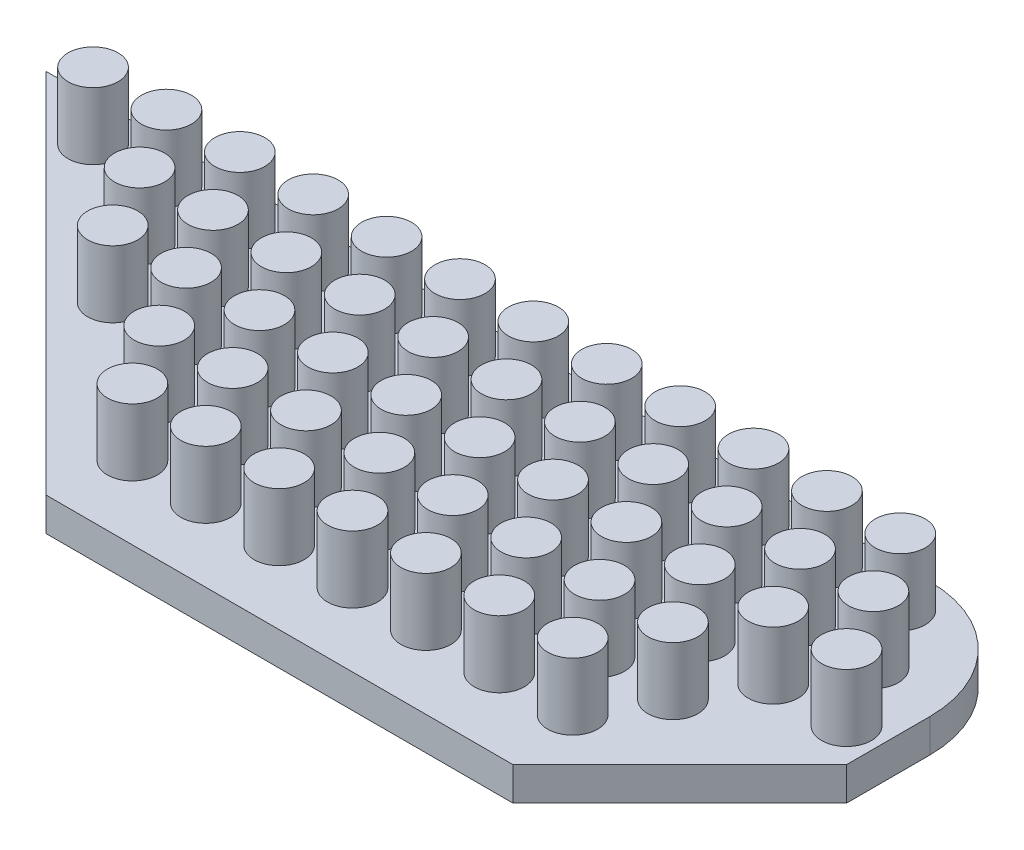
ISO-10303-21;
HEADER;
FILE_DESCRIPTION(('STEP AP214'),'2;1');
FILE_NAME('part.step','',(''),(''),'','','');
FILE_SCHEMA(('AUTOMOTIVE_DESIGN { 1 0 10303 214 1 1 1 1 }'));
ENDSEC;
DATA;
#1=APPLICATION_CONTEXT('core data for automotive mechanical design processes');
#2=APPLICATION_PROTOCOL_DEFINITION('international standard','automotive_design',2000,#1);
#3=PRODUCT_CONTEXT('',#1,'mechanical');
#4=PRODUCT('Part','Part','',(#3));
#5=PRODUCT_RELATED_PRODUCT_CATEGORY('part','',(#4));
#6=PRODUCT_DEFINITION_FORMATION('','',#4);
#7=PRODUCT_DEFINITION_CONTEXT('part definition',#1,'design');
#8=PRODUCT_DEFINITION('design','',#6,#7);
#9=PRODUCT_DEFINITION_SHAPE('','',#8);
#10=(LENGTH_UNIT() NAMED_UNIT(*) SI_UNIT(.MILLI.,.METRE.));
#11=(NAMED_UNIT(*) PLANE_ANGLE_UNIT() SI_UNIT($,.RADIAN.));
#12=(NAMED_UNIT(*) SI_UNIT($,.STERADIAN.) SOLID_ANGLE_UNIT());
#13=UNCERTAINTY_MEASURE_WITH_UNIT(LENGTH_MEASURE(1.E-05),#10,'distance_accuracy_value','');
#14=(GEOMETRIC_REPRESENTATION_CONTEXT(3) GLOBAL_UNCERTAINTY_ASSIGNED_CONTEXT((#13)) GLOBAL_UNIT_ASSIGNED_CONTEXT((#10,
#11,#12)) REPRESENTATION_CONTEXT('',''));
#15=CARTESIAN_POINT('',(0.,0.,0.));
#16=DIRECTION('',(0.,0.,1.));
#17=DIRECTION('',(1.,0.,0.));
#18=AXIS2_PLACEMENT_3D('',#15,#16,#17);
#19=CARTESIAN_POINT('',(155.,10.,-75.0000000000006));
#20=DIRECTION('',(0.,1.,0.));
#21=DIRECTION('',(0.,0.,1.));
#22=AXIS2_PLACEMENT_3D('',#19,#20,#21);
#23=PLANE('',#22);
#24=CARTESIAN_POINT('',(69.9999999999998,10.,-60.0000000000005));
#25=DIRECTION('',(0.,1.,0.));
#26=DIRECTION('',(0.,0.,1.));
#27=AXIS2_PLACEMENT_3D('',#24,#25,#26);
#28=CIRCLE('',#27,7.5);
#29=CARTESIAN_POINT('',(69.9999999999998,10.,-52.5000000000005));
#30=VERTEX_POINT('',#29);
#31=EDGE_CURVE('E115',#30,#30,#28,.T.);
#32=ORIENTED_EDGE('',*,*,#31,.F.);
#33=EDGE_LOOP('',(#32));
#34=FACE_BOUND('',#33,.T.);
#35=DIRECTION('',(0.707106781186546,0.,0.707106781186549));
#36=VECTOR('',#35,1.);
#37=CARTESIAN_POINT('',(-110.,10.,-110.000000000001));
#38=LINE('',#37,#36);
#39=CARTESIAN_POINT('',(-110.,10.,-110.000000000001));
#40=VERTEX_POINT('',#39);
#41=CARTESIAN_POINT('',(0.,10.,0.));
#42=VERTEX_POINT('',#41);
#43=EDGE_CURVE('E126',#40,#42,#38,.T.);
#44=ORIENTED_EDGE('',*,*,#43,.T.);
#45=DIRECTION('',(1.,0.,0.));
#46=VECTOR('',#45,1.);
#47=CARTESIAN_POINT('',(0.,10.,0.));
#48=LINE('',#47,#46);
#49=CARTESIAN_POINT('',(140.,10.,0.));
#50=VERTEX_POINT('',#49);
#51=EDGE_CURVE('E103',#42,#50,#48,.T.);
#52=ORIENTED_EDGE('',*,*,#51,.T.);
#53=DIRECTION('',(0.707106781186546,0.,-0.707106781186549));
#54=VECTOR('',#53,1.);
#55=CARTESIAN_POINT('',(140.,10.,0.));
#56=LINE('',#55,#54);
#57=CARTESIAN_POINT('',(190.,10.,-50.));
#58=VERTEX_POINT('',#57);
#59=EDGE_CURVE('E129',#50,#58,#56,.T.);
#60=ORIENTED_EDGE('',*,*,#59,.T.);
#61=DIRECTION('',(0.,0.,-1.));
#62=VECTOR('',#61,1.);
#63=CARTESIAN_POINT('',(190.,10.,-50.));
#64=LINE('',#63,#62);
#65=CARTESIAN_POINT('',(190.,10.,-75.0000000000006));
#66=VERTEX_POINT('',#65);
#67=EDGE_CURVE('E131',#58,#66,#64,.T.);
#68=ORIENTED_EDGE('',*,*,#67,.T.);
#69=CARTESIAN_POINT('',(155.,10.,-75.0000000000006));
#70=DIRECTION('',(0.,1.,0.));
#71=DIRECTION('',(0.,0.,1.));
#72=AXIS2_PLACEMENT_3D('',#69,#70,#71);
#73=CIRCLE('',#72,35.);
#74=CARTESIAN_POINT('',(155.,10.,-110.000000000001));
#75=VERTEX_POINT('',#74);
#76=EDGE_CURVE('E55',#66,#75,#73,.T.);
#77=ORIENTED_EDGE('',*,*,#76,.T.);
#78=DIRECTION('',(-1.,0.,0.));
#79=VECTOR('',#78,1.);
#80=CARTESIAN_POINT('',(155.,10.,-110.000000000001));
#81=LINE('',#80,#79);
#82=EDGE_CURVE('E50',#75,#40,#81,.T.);
#83=ORIENTED_EDGE('',*,*,#82,.T.);
#84=EDGE_LOOP('',(#44,#52,#60,#68,#77,#83));
#85=FACE_BOUND('',#84,.T.);
#86=CARTESIAN_POINT('',(-83.9999999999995,10.,-98.1051177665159));
#87=DIRECTION('',(0.,1.,0.));
#88=DIRECTION('',(0.,0.,1.));
#89=AXIS2_PLACEMENT_3D('',#86,#87,#88);
#90=CIRCLE('',#89,7.5);
#91=CARTESIAN_POINT('',(-83.9999999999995,10.,-90.6051177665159));
#92=VERTEX_POINT('',#91);
#93=EDGE_CURVE('E1481',#92,#92,#90,.T.);
#94=ORIENTED_EDGE('',*,*,#93,.F.);
#95=EDGE_LOOP('',(#94));
#96=FACE_BOUND('',#95,.T.);
#97=CARTESIAN_POINT('',(-61.9999999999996,10.,-98.1051177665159));
#98=DIRECTION('',(0.,1.,0.));
#99=DIRECTION('',(0.,0.,1.));
#100=AXIS2_PLACEMENT_3D('',#97,#98,#99);
#101=CIRCLE('',#100,7.5);
#102=CARTESIAN_POINT('',(-61.9999999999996,10.,-90.6051177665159));
#103=VERTEX_POINT('',#102);
#104=EDGE_CURVE('E106',#103,#103,#101,.T.);
#105=ORIENTED_EDGE('',*,*,#104,.F.);
#106=EDGE_LOOP('',(#105));
#107=FACE_BOUND('',#106,.T.);
#108=CARTESIAN_POINT('',(-50.9999999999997,10.,-79.0525588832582));
#109=DIRECTION('',(0.,1.,0.));
#110=DIRECTION('',(0.,0.,1.));
#111=AXIS2_PLACEMENT_3D('',#108,#109,#110);
#112=CIRCLE('',#111,7.5);
#113=CARTESIAN_POINT('',(-50.9999999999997,10.,-71.5525588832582));
#114=VERTEX_POINT('',#113);
#115=EDGE_CURVE('E151',#114,#114,#112,.T.);
#116=ORIENTED_EDGE('',*,*,#115,.F.);
#117=EDGE_LOOP('',(#116));
#118=FACE_BOUND('',#117,.T.);
#119=CARTESIAN_POINT('',(-39.9999999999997,10.,-60.0000000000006));
#120=DIRECTION('',(0.,1.,0.));
#121=DIRECTION('',(0.,0.,1.));
#122=AXIS2_PLACEMENT_3D('',#119,#120,#121);
#123=CIRCLE('',#122,7.5);
#124=CARTESIAN_POINT('',(-39.9999999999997,10.,-52.5000000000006));
#125=VERTEX_POINT('',#124);
#126=EDGE_CURVE('E157',#125,#125,#123,.T.);
#127=ORIENTED_EDGE('',*,*,#126,.F.);
#128=EDGE_LOOP('',(#127));
#129=FACE_BOUND('',#128,.T.);
#130=CARTESIAN_POINT('',(4.0000000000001,10.,-21.8948822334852));
#131=DIRECTION('',(0.,1.,0.));
#132=DIRECTION('',(0.,0.,1.));
#133=AXIS2_PLACEMENT_3D('',#130,#131,#132);
#134=CIRCLE('',#133,7.5);
#135=CARTESIAN_POINT('',(4.0000000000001,10.,-14.3948822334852));
#136=VERTEX_POINT('',#135);
#137=EDGE_CURVE('E163',#136,#136,#134,.T.);
#138=ORIENTED_EDGE('',*,*,#137,.F.);
#139=EDGE_LOOP('',(#138));
#140=FACE_BOUND('',#139,.T.);
#141=CARTESIAN_POINT('',(-39.9999999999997,10.,-98.1051177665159));
#142=DIRECTION('',(0.,1.,0.));
#143=DIRECTION('',(0.,0.,1.));
#144=AXIS2_PLACEMENT_3D('',#141,#142,#143);
#145=CIRCLE('',#144,7.5);
#146=CARTESIAN_POINT('',(-39.9999999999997,10.,-90.6051177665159));
#147=VERTEX_POINT('',#146);
#148=EDGE_CURVE('E169',#147,#147,#145,.T.);
#149=ORIENTED_EDGE('',*,*,#148,.F.);
#150=EDGE_LOOP('',(#149));
#151=FACE_BOUND('',#150,.T.);
#152=CARTESIAN_POINT('',(-28.9999999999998,10.,-79.0525588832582));
#153=DIRECTION('',(0.,1.,0.));
#154=DIRECTION('',(0.,0.,1.));
#155=AXIS2_PLACEMENT_3D('',#152,#153,#154);
#156=CIRCLE('',#155,7.5);
#157=CARTESIAN_POINT('',(-28.9999999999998,10.,-71.5525588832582));
#158=VERTEX_POINT('',#157);
#159=EDGE_CURVE('E175',#158,#158,#156,.T.);
#160=ORIENTED_EDGE('',*,*,#159,.F.);
#161=EDGE_LOOP('',(#160));
#162=FACE_BOUND('',#161,.T.);
#163=CARTESIAN_POINT('',(-17.9999999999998,10.,-60.0000000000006));
#164=DIRECTION('',(0.,1.,0.));
#165=DIRECTION('',(0.,0.,1.));
#166=AXIS2_PLACEMENT_3D('',#163,#164,#165);
#167=CIRCLE('',#166,7.5);
#168=CARTESIAN_POINT('',(-17.9999999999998,10.,-52.5000000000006));
#169=VERTEX_POINT('',#168);
#170=EDGE_CURVE('E181',#169,#169,#167,.T.);
#171=ORIENTED_EDGE('',*,*,#170,.F.);
#172=EDGE_LOOP('',(#171));
#173=FACE_BOUND('',#172,.T.);
#174=CARTESIAN_POINT('',(-6.99999999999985,10.,-40.9474411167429));
#175=DIRECTION('',(0.,1.,0.));
#176=DIRECTION('',(0.,0.,1.));
#177=AXIS2_PLACEMENT_3D('',#174,#175,#176);
#178=CIRCLE('',#177,7.5);
#179=CARTESIAN_POINT('',(-6.99999999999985,10.,-33.4474411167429));
#180=VERTEX_POINT('',#179);
#181=EDGE_CURVE('E187',#180,#180,#178,.T.);
#182=ORIENTED_EDGE('',*,*,#181,.F.);
#183=EDGE_LOOP('',(#182));
#184=FACE_BOUND('',#183,.T.);
#185=CARTESIAN_POINT('',(15.0000000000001,10.,-40.9474411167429));
#186=DIRECTION('',(0.,1.,0.));
#187=DIRECTION('',(0.,0.,1.));
#188=AXIS2_PLACEMENT_3D('',#185,#186,#187);
#189=CIRCLE('',#188,7.5);
#190=CARTESIAN_POINT('',(15.0000000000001,10.,-33.4474411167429));
#191=VERTEX_POINT('',#190);
#192=EDGE_CURVE('E193',#191,#191,#189,.T.);
#193=ORIENTED_EDGE('',*,*,#192,.F.);
#194=EDGE_LOOP('',(#193));
#195=FACE_BOUND('',#194,.T.);
#196=CARTESIAN_POINT('',(26.,10.,-21.8948822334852));
#197=DIRECTION('',(0.,1.,0.));
#198=DIRECTION('',(0.,0.,1.));
#199=AXIS2_PLACEMENT_3D('',#196,#197,#198);
#200=CIRCLE('',#199,7.5);
#201=CARTESIAN_POINT('',(26.,10.,-14.3948822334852));
#202=VERTEX_POINT('',#201);
#203=EDGE_CURVE('E199',#202,#202,#200,.T.);
#204=ORIENTED_EDGE('',*,*,#203,.F.);
#205=EDGE_LOOP('',(#204));
#206=FACE_BOUND('',#205,.T.);
#207=CARTESIAN_POINT('',(47.9999999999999,10.,-21.8948822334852));
#208=DIRECTION('',(0.,1.,0.));
#209=DIRECTION('',(0.,0.,1.));
#210=AXIS2_PLACEMENT_3D('',#207,#208,#209);
#211=CIRCLE('',#210,7.5);
#212=CARTESIAN_POINT('',(47.9999999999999,10.,-14.3948822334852));
#213=VERTEX_POINT('',#212);
#214=EDGE_CURVE('E205',#213,#213,#211,.T.);
#215=ORIENTED_EDGE('',*,*,#214,.F.);
#216=EDGE_LOOP('',(#215));
#217=FACE_BOUND('',#216,.T.);
#218=CARTESIAN_POINT('',(69.9999999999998,10.,-21.8948822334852));
#219=DIRECTION('',(0.,1.,0.));
#220=DIRECTION('',(0.,0.,1.));
#221=AXIS2_PLACEMENT_3D('',#218,#219,#220);
#222=CIRCLE('',#221,7.5);
#223=CARTESIAN_POINT('',(69.9999999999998,10.,-14.3948822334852));
#224=VERTEX_POINT('',#223);
#225=EDGE_CURVE('E211',#224,#224,#222,.T.);
#226=ORIENTED_EDGE('',*,*,#225,.F.);
#227=EDGE_LOOP('',(#226));
#228=FACE_BOUND('',#227,.T.);
#229=CARTESIAN_POINT('',(91.9999999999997,10.,-21.8948822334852));
#230=DIRECTION('',(0.,1.,0.));
#231=DIRECTION('',(0.,0.,1.));
#232=AXIS2_PLACEMENT_3D('',#229,#230,#231);
#233=CIRCLE('',#232,7.5);
#234=CARTESIAN_POINT('',(91.9999999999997,10.,-14.3948822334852));
#235=VERTEX_POINT('',#234);
#236=EDGE_CURVE('E217',#235,#235,#233,.T.);
#237=ORIENTED_EDGE('',*,*,#236,.F.);
#238=EDGE_LOOP('',(#237));
#239=FACE_BOUND('',#238,.T.);
#240=CARTESIAN_POINT('',(114.,10.,-21.8948822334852));
#241=DIRECTION('',(0.,1.,0.));
#242=DIRECTION('',(0.,0.,1.));
#243=AXIS2_PLACEMENT_3D('',#240,#241,#242);
#244=CIRCLE('',#243,7.5);
#245=CARTESIAN_POINT('',(114.,10.,-14.3948822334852));
#246=VERTEX_POINT('',#245);
#247=EDGE_CURVE('E223',#246,#246,#244,.T.);
#248=ORIENTED_EDGE('',*,*,#247,.F.);
#249=EDGE_LOOP('',(#248));
#250=FACE_BOUND('',#249,.T.);
#251=CARTESIAN_POINT('',(136.,10.,-21.8948822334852));
#252=DIRECTION('',(0.,1.,0.));
#253=DIRECTION('',(0.,0.,1.));
#254=AXIS2_PLACEMENT_3D('',#251,#252,#253);
#255=CIRCLE('',#254,7.5);
#256=CARTESIAN_POINT('',(136.,10.,-14.3948822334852));
#257=VERTEX_POINT('',#256);
#258=EDGE_CURVE('E229',#257,#257,#255,.T.);
#259=ORIENTED_EDGE('',*,*,#258,.F.);
#260=EDGE_LOOP('',(#259));
#261=FACE_BOUND('',#260,.T.);
#262=CARTESIAN_POINT('',(-17.9999999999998,10.,-98.1051177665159));
#263=DIRECTION('',(0.,1.,0.));
#264=DIRECTION('',(0.,0.,1.));
#265=AXIS2_PLACEMENT_3D('',#262,#263,#264);
#266=CIRCLE('',#265,7.5);
#267=CARTESIAN_POINT('',(-17.9999999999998,10.,-90.6051177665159));
#268=VERTEX_POINT('',#267);
#269=EDGE_CURVE('E235',#268,#268,#266,.T.);
#270=ORIENTED_EDGE('',*,*,#269,.F.);
#271=EDGE_LOOP('',(#270));
#272=FACE_BOUND('',#271,.T.);
#273=CARTESIAN_POINT('',(-6.99999999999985,10.,-79.0525588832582));
#274=DIRECTION('',(0.,1.,0.));
#275=DIRECTION('',(0.,0.,1.));
#276=AXIS2_PLACEMENT_3D('',#273,#274,#275);
#277=CIRCLE('',#276,7.5);
#278=CARTESIAN_POINT('',(-6.99999999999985,10.,-71.5525588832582));
#279=VERTEX_POINT('',#278);
#280=EDGE_CURVE('E241',#279,#279,#277,.T.);
#281=ORIENTED_EDGE('',*,*,#280,.F.);
#282=EDGE_LOOP('',(#281));
#283=FACE_BOUND('',#282,.T.);
#284=CARTESIAN_POINT('',(4.0000000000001,10.,-60.0000000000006));
#285=DIRECTION('',(0.,1.,0.));
#286=DIRECTION('',(0.,0.,1.));
#287=AXIS2_PLACEMENT_3D('',#284,#285,#286);
#288=CIRCLE('',#287,7.5);
#289=CARTESIAN_POINT('',(4.0000000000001,10.,-52.5000000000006));
#290=VERTEX_POINT('',#289);
#291=EDGE_CURVE('E247',#290,#290,#288,.T.);
#292=ORIENTED_EDGE('',*,*,#291,.F.);
#293=EDGE_LOOP('',(#292));
#294=FACE_BOUND('',#293,.T.);
#295=CARTESIAN_POINT('',(26.,10.,-60.0000000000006));
#296=DIRECTION('',(0.,1.,0.));
#297=DIRECTION('',(0.,0.,1.));
#298=AXIS2_PLACEMENT_3D('',#295,#296,#297);
#299=CIRCLE('',#298,7.5);
#300=CARTESIAN_POINT('',(26.,10.,-52.5000000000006));
#301=VERTEX_POINT('',#300);
#302=EDGE_CURVE('E253',#301,#301,#299,.T.);
#303=ORIENTED_EDGE('',*,*,#302,.F.);
#304=EDGE_LOOP('',(#303));
#305=FACE_BOUND('',#304,.T.);
#306=CARTESIAN_POINT('',(37.,10.,-40.9474411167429));
#307=DIRECTION('',(0.,1.,0.));
#308=DIRECTION('',(0.,0.,1.));
#309=AXIS2_PLACEMENT_3D('',#306,#307,#308);
#310=CIRCLE('',#309,7.5);
#311=CARTESIAN_POINT('',(37.,10.,-33.4474411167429));
#312=VERTEX_POINT('',#311);
#313=EDGE_CURVE('E259',#312,#312,#310,.T.);
#314=ORIENTED_EDGE('',*,*,#313,.F.);
#315=EDGE_LOOP('',(#314));
#316=FACE_BOUND('',#315,.T.);
#317=CARTESIAN_POINT('',(58.9999999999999,10.,-40.9474411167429));
#318=DIRECTION('',(0.,1.,0.));
#319=DIRECTION('',(0.,0.,1.));
#320=AXIS2_PLACEMENT_3D('',#317,#318,#319);
#321=CIRCLE('',#320,7.5);
#322=CARTESIAN_POINT('',(58.9999999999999,10.,-33.4474411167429));
#323=VERTEX_POINT('',#322);
#324=EDGE_CURVE('E265',#323,#323,#321,.T.);
#325=ORIENTED_EDGE('',*,*,#324,.F.);
#326=EDGE_LOOP('',(#325));
#327=FACE_BOUND('',#326,.T.);
#328=CARTESIAN_POINT('',(80.9999999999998,10.,-40.9474411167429));
#329=DIRECTION('',(0.,1.,0.));
#330=DIRECTION('',(0.,0.,1.));
#331=AXIS2_PLACEMENT_3D('',#328,#329,#330);
#332=CIRCLE('',#331,7.5);
#333=CARTESIAN_POINT('',(80.9999999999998,10.,-33.4474411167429));
#334=VERTEX_POINT('',#333);
#335=EDGE_CURVE('E271',#334,#334,#332,.T.);
#336=ORIENTED_EDGE('',*,*,#335,.F.);
#337=EDGE_LOOP('',(#336));
#338=FACE_BOUND('',#337,.T.);
#339=CARTESIAN_POINT('',(103.,10.,-40.9474411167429));
#340=DIRECTION('',(0.,1.,0.));
#341=DIRECTION('',(0.,0.,1.));
#342=AXIS2_PLACEMENT_3D('',#339,#340,#341);
#343=CIRCLE('',#342,7.5);
#344=CARTESIAN_POINT('',(103.,10.,-33.4474411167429));
#345=VERTEX_POINT('',#344);
#346=EDGE_CURVE('E277',#345,#345,#343,.T.);
#347=ORIENTED_EDGE('',*,*,#346,.F.);
#348=EDGE_LOOP('',(#347));
#349=FACE_BOUND('',#348,.T.);
#350=CARTESIAN_POINT('',(125.,10.,-40.9474411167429));
#351=DIRECTION('',(0.,1.,0.));
#352=DIRECTION('',(0.,0.,1.));
#353=AXIS2_PLACEMENT_3D('',#350,#351,#352);
#354=CIRCLE('',#353,7.5);
#355=CARTESIAN_POINT('',(125.,10.,-33.4474411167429));
#356=VERTEX_POINT('',#355);
#357=EDGE_CURVE('E283',#356,#356,#354,.T.);
#358=ORIENTED_EDGE('',*,*,#357,.F.);
#359=EDGE_LOOP('',(#358));
#360=FACE_BOUND('',#359,.T.);
#361=CARTESIAN_POINT('',(147.,10.,-40.9474411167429));
#362=DIRECTION('',(0.,1.,0.));
#363=DIRECTION('',(0.,0.,1.));
#364=AXIS2_PLACEMENT_3D('',#361,#362,#363);
#365=CIRCLE('',#364,7.5);
#366=CARTESIAN_POINT('',(147.,10.,-33.4474411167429));
#367=VERTEX_POINT('',#366);
#368=EDGE_CURVE('E289',#367,#367,#365,.T.);
#369=ORIENTED_EDGE('',*,*,#368,.F.);
#370=EDGE_LOOP('',(#369));
#371=FACE_BOUND('',#370,.T.);
#372=CARTESIAN_POINT('',(179.999999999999,10.,-60.0000000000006));
#373=DIRECTION('',(0.,1.,0.));
#374=DIRECTION('',(0.,0.,1.));
#375=AXIS2_PLACEMENT_3D('',#372,#373,#374);
#376=CIRCLE('',#375,7.5);
#377=CARTESIAN_POINT('',(179.999999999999,10.,-52.5000000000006));
#378=VERTEX_POINT('',#377);
#379=EDGE_CURVE('E295',#378,#378,#376,.T.);
#380=ORIENTED_EDGE('',*,*,#379,.F.);
#381=EDGE_LOOP('',(#380));
#382=FACE_BOUND('',#381,.T.);
#383=CARTESIAN_POINT('',(4.0000000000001,10.,-98.1051177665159));
#384=DIRECTION('',(0.,1.,0.));
#385=DIRECTION('',(0.,0.,1.));
#386=AXIS2_PLACEMENT_3D('',#383,#384,#385);
#387=CIRCLE('',#386,7.5);
#388=CARTESIAN_POINT('',(4.0000000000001,10.,-90.6051177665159));
#389=VERTEX_POINT('',#388);
#390=EDGE_CURVE('E301',#389,#389,#387,.T.);
#391=ORIENTED_EDGE('',*,*,#390,.F.);
#392=EDGE_LOOP('',(#391));
#393=FACE_BOUND('',#392,.T.);
#394=CARTESIAN_POINT('',(15.0000000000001,10.,-79.0525588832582));
#395=DIRECTION('',(0.,1.,0.));
#396=DIRECTION('',(0.,0.,1.));
#397=AXIS2_PLACEMENT_3D('',#394,#395,#396);
#398=CIRCLE('',#397,7.5);
#399=CARTESIAN_POINT('',(15.0000000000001,10.,-71.5525588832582));
#400=VERTEX_POINT('',#399);
#401=EDGE_CURVE('E307',#400,#400,#398,.T.);
#402=ORIENTED_EDGE('',*,*,#401,.F.);
#403=EDGE_LOOP('',(#402));
#404=FACE_BOUND('',#403,.T.);
#405=CARTESIAN_POINT('',(37.,10.,-79.0525588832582));
#406=DIRECTION('',(0.,1.,0.));
#407=DIRECTION('',(0.,0.,1.));
#408=AXIS2_PLACEMENT_3D('',#405,#406,#407);
#409=CIRCLE('',#408,7.5);
#410=CARTESIAN_POINT('',(37.,10.,-71.5525588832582));
#411=VERTEX_POINT('',#410);
#412=EDGE_CURVE('E313',#411,#411,#409,.T.);
#413=ORIENTED_EDGE('',*,*,#412,.F.);
#414=EDGE_LOOP('',(#413));
#415=FACE_BOUND('',#414,.T.);
#416=CARTESIAN_POINT('',(47.9999999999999,10.,-60.0000000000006));
#417=DIRECTION('',(0.,1.,0.));
#418=DIRECTION('',(0.,0.,1.));
#419=AXIS2_PLACEMENT_3D('',#416,#417,#418);
#420=CIRCLE('',#419,7.5);
#421=CARTESIAN_POINT('',(47.9999999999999,10.,-52.5000000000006));
#422=VERTEX_POINT('',#421);
#423=EDGE_CURVE('E319',#422,#422,#420,.T.);
#424=ORIENTED_EDGE('',*,*,#423,.F.);
#425=EDGE_LOOP('',(#424));
#426=FACE_BOUND('',#425,.T.);
#427=CARTESIAN_POINT('',(91.9999999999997,10.,-60.0000000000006));
#428=DIRECTION('',(0.,1.,0.));
#429=DIRECTION('',(0.,0.,1.));
#430=AXIS2_PLACEMENT_3D('',#427,#428,#429);
#431=CIRCLE('',#430,7.5);
#432=CARTESIAN_POINT('',(91.9999999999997,10.,-52.5000000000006));
#433=VERTEX_POINT('',#432);
#434=EDGE_CURVE('E325',#433,#433,#431,.T.);
#435=ORIENTED_EDGE('',*,*,#434,.F.);
#436=EDGE_LOOP('',(#435));
#437=FACE_BOUND('',#436,.T.);
#438=CARTESIAN_POINT('',(114.,10.,-60.0000000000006));
#439=DIRECTION('',(0.,1.,0.));
#440=DIRECTION('',(0.,0.,1.));
#441=AXIS2_PLACEMENT_3D('',#438,#439,#440);
#442=CIRCLE('',#441,7.5);
#443=CARTESIAN_POINT('',(114.,10.,-52.5000000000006));
#444=VERTEX_POINT('',#443);
#445=EDGE_CURVE('E331',#444,#444,#442,.T.);
#446=ORIENTED_EDGE('',*,*,#445,.F.);
#447=EDGE_LOOP('',(#446));
#448=FACE_BOUND('',#447,.T.);
#449=CARTESIAN_POINT('',(136.,10.,-60.0000000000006));
#450=DIRECTION('',(0.,1.,0.));
#451=DIRECTION('',(0.,0.,1.));
#452=AXIS2_PLACEMENT_3D('',#449,#450,#451);
#453=CIRCLE('',#452,7.5);
#454=CARTESIAN_POINT('',(136.,10.,-52.5000000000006));
#455=VERTEX_POINT('',#454);
#456=EDGE_CURVE('E337',#455,#455,#453,.T.);
#457=ORIENTED_EDGE('',*,*,#456,.F.);
#458=EDGE_LOOP('',(#457));
#459=FACE_BOUND('',#458,.T.);
#460=CARTESIAN_POINT('',(157.999999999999,10.,-60.0000000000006));
#461=DIRECTION('',(0.,1.,0.));
#462=DIRECTION('',(0.,0.,1.));
#463=AXIS2_PLACEMENT_3D('',#460,#461,#462);
#464=CIRCLE('',#463,7.5);
#465=CARTESIAN_POINT('',(157.999999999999,10.,-52.5000000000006));
#466=VERTEX_POINT('',#465);
#467=EDGE_CURVE('E343',#466,#466,#464,.T.);
#468=ORIENTED_EDGE('',*,*,#467,.F.);
#469=EDGE_LOOP('',(#468));
#470=FACE_BOUND('',#469,.T.);
#471=CARTESIAN_POINT('',(26.,10.,-98.1051177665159));
#472=DIRECTION('',(0.,1.,0.));
#473=DIRECTION('',(0.,0.,1.));
#474=AXIS2_PLACEMENT_3D('',#471,#472,#473);
#475=CIRCLE('',#474,7.5);
#476=CARTESIAN_POINT('',(26.,10.,-90.6051177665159));
#477=VERTEX_POINT('',#476);
#478=EDGE_CURVE('E349',#477,#477,#475,.T.);
#479=ORIENTED_EDGE('',*,*,#478,.F.);
#480=EDGE_LOOP('',(#479));
#481=FACE_BOUND('',#480,.T.);
#482=CARTESIAN_POINT('',(47.9999999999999,10.,-98.1051177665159));
#483=DIRECTION('',(0.,1.,0.));
#484=DIRECTION('',(0.,0.,1.));
#485=AXIS2_PLACEMENT_3D('',#482,#483,#484);
#486=CIRCLE('',#485,7.5);
#487=CARTESIAN_POINT('',(47.9999999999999,10.,-90.6051177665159));
#488=VERTEX_POINT('',#487);
#489=EDGE_CURVE('E355',#488,#488,#486,.T.);
#490=ORIENTED_EDGE('',*,*,#489,.F.);
#491=EDGE_LOOP('',(#490));
#492=FACE_BOUND('',#491,.T.);
#493=CARTESIAN_POINT('',(58.9999999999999,10.,-79.0525588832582));
#494=DIRECTION('',(0.,1.,0.));
#495=DIRECTION('',(0.,0.,1.));
#496=AXIS2_PLACEMENT_3D('',#493,#494,#495);
#497=CIRCLE('',#496,7.5);
#498=CARTESIAN_POINT('',(58.9999999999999,10.,-71.5525588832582));
#499=VERTEX_POINT('',#498);
#500=EDGE_CURVE('E361',#499,#499,#497,.T.);
#501=ORIENTED_EDGE('',*,*,#500,.F.);
#502=EDGE_LOOP('',(#501));
#503=FACE_BOUND('',#502,.T.);
#504=CARTESIAN_POINT('',(80.9999999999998,10.,-79.0525588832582));
#505=DIRECTION('',(0.,1.,0.));
#506=DIRECTION('',(0.,0.,1.));
#507=AXIS2_PLACEMENT_3D('',#504,#505,#506);
#508=CIRCLE('',#507,7.5);
#509=CARTESIAN_POINT('',(80.9999999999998,10.,-71.5525588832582));
#510=VERTEX_POINT('',#509);
#511=EDGE_CURVE('E367',#510,#510,#508,.T.);
#512=ORIENTED_EDGE('',*,*,#511,.F.);
#513=EDGE_LOOP('',(#512));
#514=FACE_BOUND('',#513,.T.);
#515=CARTESIAN_POINT('',(103.,10.,-79.0525588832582));
#516=DIRECTION('',(0.,1.,0.));
#517=DIRECTION('',(0.,0.,1.));
#518=AXIS2_PLACEMENT_3D('',#515,#516,#517);
#519=CIRCLE('',#518,7.5);
#520=CARTESIAN_POINT('',(103.,10.,-71.5525588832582));
#521=VERTEX_POINT('',#520);
#522=EDGE_CURVE('E373',#521,#521,#519,.T.);
#523=ORIENTED_EDGE('',*,*,#522,.F.);
#524=EDGE_LOOP('',(#523));
#525=FACE_BOUND('',#524,.T.);
#526=CARTESIAN_POINT('',(125.,10.,-79.0525588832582));
#527=DIRECTION('',(0.,1.,0.));
#528=DIRECTION('',(0.,0.,1.));
#529=AXIS2_PLACEMENT_3D('',#526,#527,#528);
#530=CIRCLE('',#529,7.5);
#531=CARTESIAN_POINT('',(125.,10.,-71.5525588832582));
#532=VERTEX_POINT('',#531);
#533=EDGE_CURVE('E379',#532,#532,#530,.T.);
#534=ORIENTED_EDGE('',*,*,#533,.F.);
#535=EDGE_LOOP('',(#534));
#536=FACE_BOUND('',#535,.T.);
#537=CARTESIAN_POINT('',(147.,10.,-79.0525588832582));
#538=DIRECTION('',(0.,1.,0.));
#539=DIRECTION('',(0.,0.,1.));
#540=AXIS2_PLACEMENT_3D('',#537,#538,#539);
#541=CIRCLE('',#540,7.5);
#542=CARTESIAN_POINT('',(147.,10.,-71.5525588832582));
#543=VERTEX_POINT('',#542);
#544=EDGE_CURVE('E385',#543,#543,#541,.T.);
#545=ORIENTED_EDGE('',*,*,#544,.F.);
#546=EDGE_LOOP('',(#545));
#547=FACE_BOUND('',#546,.T.);
#548=CARTESIAN_POINT('',(168.999999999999,10.,-79.0525588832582));
#549=DIRECTION('',(0.,1.,0.));
#550=DIRECTION('',(0.,0.,1.));
#551=AXIS2_PLACEMENT_3D('',#548,#549,#550);
#552=CIRCLE('',#551,7.5);
#553=CARTESIAN_POINT('',(168.999999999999,10.,-71.5525588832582));
#554=VERTEX_POINT('',#553);
#555=EDGE_CURVE('E391',#554,#554,#552,.T.);
#556=ORIENTED_EDGE('',*,*,#555,.F.);
#557=EDGE_LOOP('',(#556));
#558=FACE_BOUND('',#557,.T.);
#559=CARTESIAN_POINT('',(69.9999999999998,10.,-98.1051177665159));
#560=DIRECTION('',(0.,1.,0.));
#561=DIRECTION('',(0.,0.,1.));
#562=AXIS2_PLACEMENT_3D('',#559,#560,#561);
#563=CIRCLE('',#562,7.5);
#564=CARTESIAN_POINT('',(69.9999999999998,10.,-90.6051177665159));
#565=VERTEX_POINT('',#564);
#566=EDGE_CURVE('E397',#565,#565,#563,.T.);
#567=ORIENTED_EDGE('',*,*,#566,.F.);
#568=EDGE_LOOP('',(#567));
#569=FACE_BOUND('',#568,.T.);
#570=CARTESIAN_POINT('',(91.9999999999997,10.,-98.1051177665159));
#571=DIRECTION('',(0.,1.,0.));
#572=DIRECTION('',(0.,0.,1.));
#573=AXIS2_PLACEMENT_3D('',#570,#571,#572);
#574=CIRCLE('',#573,7.5);
#575=CARTESIAN_POINT('',(91.9999999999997,10.,-90.6051177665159));
#576=VERTEX_POINT('',#575);
#577=EDGE_CURVE('E403',#576,#576,#574,.T.);
#578=ORIENTED_EDGE('',*,*,#577,.F.);
#579=EDGE_LOOP('',(#578));
#580=FACE_BOUND('',#579,.T.);
#581=CARTESIAN_POINT('',(114.,10.,-98.1051177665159));
#582=DIRECTION('',(0.,1.,0.));
#583=DIRECTION('',(0.,0.,1.));
#584=AXIS2_PLACEMENT_3D('',#581,#582,#583);
#585=CIRCLE('',#584,7.5);
#586=CARTESIAN_POINT('',(114.,10.,-90.6051177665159));
#587=VERTEX_POINT('',#586);
#588=EDGE_CURVE('E409',#587,#587,#585,.T.);
#589=ORIENTED_EDGE('',*,*,#588,.F.);
#590=EDGE_LOOP('',(#589));
#591=FACE_BOUND('',#590,.T.);
#592=CARTESIAN_POINT('',(136.,10.,-98.1051177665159));
#593=DIRECTION('',(0.,1.,0.));
#594=DIRECTION('',(0.,0.,1.));
#595=AXIS2_PLACEMENT_3D('',#592,#593,#594);
#596=CIRCLE('',#595,7.5);
#597=CARTESIAN_POINT('',(136.,10.,-90.6051177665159));
#598=VERTEX_POINT('',#597);
#599=EDGE_CURVE('E415',#598,#598,#596,.T.);
#600=ORIENTED_EDGE('',*,*,#599,.F.);
#601=EDGE_LOOP('',(#600));
#602=FACE_BOUND('',#601,.T.);
#603=CARTESIAN_POINT('',(157.999999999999,10.,-98.1051177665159));
#604=DIRECTION('',(0.,1.,0.));
#605=DIRECTION('',(0.,0.,1.));
#606=AXIS2_PLACEMENT_3D('',#603,#604,#605);
#607=CIRCLE('',#606,7.5);
#608=CARTESIAN_POINT('',(157.999999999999,10.,-90.6051177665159));
#609=VERTEX_POINT('',#608);
#610=EDGE_CURVE('E43',#609,#609,#607,.T.);
#611=ORIENTED_EDGE('',*,*,#610,.F.);
#612=EDGE_LOOP('',(#611));
#613=FACE_BOUND('',#612,.T.);
#614=ADVANCED_FACE('F35',(#34,#85,#96,#107,#118,#129,#140,#151,#162,#173,#184,#195,#206,#217,
#228,#239,#250,#261,#272,#283,#294,#305,#316,#327,#338,#349,#360,#371,#382,#393,#404,#415,#426,
#437,#448,#459,#470,#481,#492,#503,#514,#525,#536,#547,#558,#569,#580,#591,#602,#613),#23,.T.);
#615=CARTESIAN_POINT('',(-110.,10.,-110.000000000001));
#616=DIRECTION('',(0.707106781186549,0.,-0.707106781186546));
#617=DIRECTION('',(-0.707106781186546,0.,-0.707106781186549));
#618=AXIS2_PLACEMENT_3D('',#615,#616,#617);
#619=PLANE('',#618);
#620=DIRECTION('',(0.707106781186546,0.,0.707106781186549));
#621=VECTOR('',#620,1.);
#622=CARTESIAN_POINT('',(-110.,0.,-110.000000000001));
#623=LINE('',#622,#621);
#624=CARTESIAN_POINT('',(-110.,0.,-110.000000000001));
#625=VERTEX_POINT('',#624);
#626=CARTESIAN_POINT('',(0.,0.,0.));
#627=VERTEX_POINT('',#626);
#628=EDGE_CURVE('E93',#625,#627,#623,.T.);
#629=ORIENTED_EDGE('',*,*,#628,.T.);
#630=DIRECTION('',(0.,-1.,0.));
#631=VECTOR('',#630,1.);
#632=CARTESIAN_POINT('',(0.,10.,0.));
#633=LINE('',#632,#631);
#634=EDGE_CURVE('E101',#42,#627,#633,.T.);
#635=ORIENTED_EDGE('',*,*,#634,.F.);
#636=ORIENTED_EDGE('',*,*,#43,.F.);
#637=DIRECTION('',(0.,-1.,0.));
#638=VECTOR('',#637,1.);
#639=CARTESIAN_POINT('',(-110.,10.,-110.000000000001));
#640=LINE('',#639,#638);
#641=EDGE_CURVE('E111',#40,#625,#640,.T.);
#642=ORIENTED_EDGE('',*,*,#641,.T.);
#643=EDGE_LOOP('',(#629,#635,#636,#642));
#644=FACE_BOUND('',#643,.T.);
#645=ADVANCED_FACE('F110',(#644),#619,.F.);
#646=CARTESIAN_POINT('',(0.,10.,0.));
#647=DIRECTION('',(0.,0.,-1.));
#648=DIRECTION('',(-1.,0.,0.));
#649=AXIS2_PLACEMENT_3D('',#646,#647,#648);
#650=PLANE('',#649);
#651=DIRECTION('',(1.,0.,0.));
#652=VECTOR('',#651,1.);
#653=CARTESIAN_POINT('',(0.,0.,0.));
#654=LINE('',#653,#652);
#655=CARTESIAN_POINT('',(140.,0.,0.));
#656=VERTEX_POINT('',#655);
#657=EDGE_CURVE('E88',#627,#656,#654,.T.);
#658=ORIENTED_EDGE('',*,*,#657,.T.);
#659=DIRECTION('',(0.,-1.,0.));
#660=VECTOR('',#659,1.);
#661=CARTESIAN_POINT('',(140.,10.,0.));
#662=LINE('',#661,#660);
#663=EDGE_CURVE('E107',#50,#656,#662,.T.);
#664=ORIENTED_EDGE('',*,*,#663,.F.);
#665=ORIENTED_EDGE('',*,*,#51,.F.);
#666=ORIENTED_EDGE('',*,*,#634,.T.);
#667=EDGE_LOOP('',(#658,#664,#665,#666));
#668=FACE_BOUND('',#667,.T.);
#669=ADVANCED_FACE('F102',(#668),#650,.F.);
#670=CARTESIAN_POINT('',(140.,10.,0.));
#671=DIRECTION('',(-0.707106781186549,0.,-0.707106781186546));
#672=DIRECTION('',(-0.707106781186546,0.,0.707106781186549));
#673=AXIS2_PLACEMENT_3D('',#670,#671,#672);
#674=PLANE('',#673);
#675=DIRECTION('',(0.707106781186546,0.,-0.707106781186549));
#676=VECTOR('',#675,1.);
#677=CARTESIAN_POINT('',(140.,0.,0.));
#678=LINE('',#677,#676);
#679=CARTESIAN_POINT('',(190.,0.,-50.));
#680=VERTEX_POINT('',#679);
#681=EDGE_CURVE('E95',#656,#680,#678,.T.);
#682=ORIENTED_EDGE('',*,*,#681,.T.);
#683=DIRECTION('',(0.,-1.,0.));
#684=VECTOR('',#683,1.);
#685=CARTESIAN_POINT('',(190.,10.,-50.));
#686=LINE('',#685,#684);
#687=EDGE_CURVE('E142',#58,#680,#686,.T.);
#688=ORIENTED_EDGE('',*,*,#687,.F.);
#689=ORIENTED_EDGE('',*,*,#59,.F.);
#690=ORIENTED_EDGE('',*,*,#663,.T.);
#691=EDGE_LOOP('',(#682,#688,#689,#690));
#692=FACE_BOUND('',#691,.T.);
#693=ADVANCED_FACE('F447',(#692),#674,.F.);
#694=CARTESIAN_POINT('',(190.,10.,-50.));
#695=DIRECTION('',(-1.,0.,0.));
#696=DIRECTION('',(0.,0.,1.));
#697=AXIS2_PLACEMENT_3D('',#694,#695,#696);
#698=PLANE('',#697);
#699=DIRECTION('',(0.,0.,-1.));
#700=VECTOR('',#699,1.);
#701=CARTESIAN_POINT('',(190.,0.,-50.));
#702=LINE('',#701,#700);
#703=CARTESIAN_POINT('',(190.,0.,-75.0000000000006));
#704=VERTEX_POINT('',#703);
#705=EDGE_CURVE('E120',#680,#704,#702,.T.);
#706=ORIENTED_EDGE('',*,*,#705,.T.);
#707=DIRECTION('',(0.,-1.,0.));
#708=VECTOR('',#707,1.);
#709=CARTESIAN_POINT('',(190.,10.,-75.0000000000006));
#710=LINE('',#709,#708);
#711=EDGE_CURVE('E139',#66,#704,#710,.T.);
#712=ORIENTED_EDGE('',*,*,#711,.F.);
#713=ORIENTED_EDGE('',*,*,#67,.F.);
#714=ORIENTED_EDGE('',*,*,#687,.T.);
#715=EDGE_LOOP('',(#706,#712,#713,#714));
#716=FACE_BOUND('',#715,.T.);
#717=ADVANCED_FACE('F443',(#716),#698,.F.);
#718=CARTESIAN_POINT('',(155.,10.,-75.0000000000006));
#719=DIRECTION('',(0.,-1.,0.));
#720=DIRECTION('',(0.,0.,-1.));
#721=AXIS2_PLACEMENT_3D('',#718,#719,#720);
#722=CYLINDRICAL_SURFACE('',#721,35.);
#723=CARTESIAN_POINT('',(155.,0.,-75.0000000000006));
#724=DIRECTION('',(0.,1.,0.));
#725=DIRECTION('',(0.,0.,1.));
#726=AXIS2_PLACEMENT_3D('',#723,#724,#725);
#727=CIRCLE('',#726,35.);
#728=CARTESIAN_POINT('',(155.,0.,-110.000000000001));
#729=VERTEX_POINT('',#728);
#730=EDGE_CURVE('E122',#704,#729,#727,.T.);
#731=ORIENTED_EDGE('',*,*,#730,.T.);
#732=DIRECTION('',(0.,-1.,0.));
#733=VECTOR('',#732,1.);
#734=CARTESIAN_POINT('',(155.,10.,-110.000000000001));
#735=LINE('',#734,#733);
#736=EDGE_CURVE('E136',#75,#729,#735,.T.);
#737=ORIENTED_EDGE('',*,*,#736,.F.);
#738=ORIENTED_EDGE('',*,*,#76,.F.);
#739=ORIENTED_EDGE('',*,*,#711,.T.);
#740=EDGE_LOOP('',(#731,#737,#738,#739));
#741=FACE_BOUND('',#740,.T.);
#742=ADVANCED_FACE('F439',(#741),#722,.T.);
#743=CARTESIAN_POINT('',(155.,10.,-110.000000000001));
#744=DIRECTION('',(0.,0.,1.));
#745=DIRECTION('',(1.,0.,0.));
#746=AXIS2_PLACEMENT_3D('',#743,#744,#745);
#747=PLANE('',#746);
#748=DIRECTION('',(-1.,0.,0.));
#749=VECTOR('',#748,1.);
#750=CARTESIAN_POINT('',(155.,0.,-110.000000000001));
#751=LINE('',#750,#749);
#752=EDGE_CURVE('E124',#729,#625,#751,.T.);
#753=ORIENTED_EDGE('',*,*,#752,.T.);
#754=ORIENTED_EDGE('',*,*,#641,.F.);
#755=ORIENTED_EDGE('',*,*,#82,.F.);
#756=ORIENTED_EDGE('',*,*,#736,.T.);
#757=EDGE_LOOP('',(#753,#754,#755,#756));
#758=FACE_BOUND('',#757,.T.);
#759=ADVANCED_FACE('F436',(#758),#747,.F.);
#760=CARTESIAN_POINT('',(155.,0.,-75.0000000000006));
#761=DIRECTION('',(0.,1.,0.));
#762=DIRECTION('',(0.,0.,1.));
#763=AXIS2_PLACEMENT_3D('',#760,#761,#762);
#764=PLANE('',#763);
#765=ORIENTED_EDGE('',*,*,#628,.F.);
#766=ORIENTED_EDGE('',*,*,#752,.F.);
#767=ORIENTED_EDGE('',*,*,#730,.F.);
#768=ORIENTED_EDGE('',*,*,#705,.F.);
#769=ORIENTED_EDGE('',*,*,#681,.F.);
#770=ORIENTED_EDGE('',*,*,#657,.F.);
#771=EDGE_LOOP('',(#765,#766,#767,#768,#769,#770));
#772=FACE_BOUND('',#771,.T.);
#773=ADVANCED_FACE('F90',(#772),#764,.F.);
#774=CARTESIAN_POINT('',(69.9999999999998,30.,-60.0000000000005));
#775=DIRECTION('',(0.,-1.,0.));
#776=DIRECTION('',(0.,0.,-1.));
#777=AXIS2_PLACEMENT_3D('',#774,#775,#776);
#778=CYLINDRICAL_SURFACE('',#777,7.5);
#779=CARTESIAN_POINT('',(69.9999999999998,30.,-60.0000000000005));
#780=DIRECTION('',(0.,1.,0.));
#781=DIRECTION('',(0.,0.,1.));
#782=AXIS2_PLACEMENT_3D('',#779,#780,#781);
#783=CIRCLE('',#782,7.5);
#784=CARTESIAN_POINT('',(69.9999999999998,30.,-52.5000000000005));
#785=VERTEX_POINT('',#784);
#786=EDGE_CURVE('E112',#785,#785,#783,.T.);
#787=ORIENTED_EDGE('',*,*,#786,.F.);
#788=EDGE_LOOP('',(#787));
#789=FACE_BOUND('',#788,.T.);
#790=ORIENTED_EDGE('',*,*,#31,.T.);
#791=EDGE_LOOP('',(#790));
#792=FACE_BOUND('',#791,.T.);
#793=ADVANCED_FACE('F1221',(#789,#792),#778,.T.);
#794=CARTESIAN_POINT('',(69.9999999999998,30.,-60.0000000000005));
#795=DIRECTION('',(0.,1.,0.));
#796=DIRECTION('',(0.,0.,1.));
#797=AXIS2_PLACEMENT_3D('',#794,#795,#796);
#798=PLANE('',#797);
#799=ORIENTED_EDGE('',*,*,#786,.T.);
#800=EDGE_LOOP('',(#799));
#801=FACE_BOUND('',#800,.T.);
#802=ADVANCED_FACE('F1208',(#801),#798,.T.);
#803=CARTESIAN_POINT('',(-83.9999999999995,30.,-98.1051177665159));
#804=DIRECTION('',(0.,-1.,0.));
#805=DIRECTION('',(0.,0.,-1.));
#806=AXIS2_PLACEMENT_3D('',#803,#804,#805);
#807=CYLINDRICAL_SURFACE('',#806,7.5);
#808=CARTESIAN_POINT('',(-83.9999999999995,30.,-98.1051177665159));
#809=DIRECTION('',(0.,1.,0.));
#810=DIRECTION('',(0.,0.,1.));
#811=AXIS2_PLACEMENT_3D('',#808,#809,#810);
#812=CIRCLE('',#811,7.5);
#813=CARTESIAN_POINT('',(-83.9999999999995,30.,-90.6051177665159));
#814=VERTEX_POINT('',#813);
#815=EDGE_CURVE('E1479',#814,#814,#812,.T.);
#816=ORIENTED_EDGE('',*,*,#815,.F.);
#817=EDGE_LOOP('',(#816));
#818=FACE_BOUND('',#817,.T.);
#819=ORIENTED_EDGE('',*,*,#93,.T.);
#820=EDGE_LOOP('',(#819));
#821=FACE_BOUND('',#820,.T.);
#822=ADVANCED_FACE('F464',(#818,#821),#807,.T.);
#823=CARTESIAN_POINT('',(-83.9999999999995,30.,-98.1051177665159));
#824=DIRECTION('',(0.,1.,0.));
#825=DIRECTION('',(0.,0.,1.));
#826=AXIS2_PLACEMENT_3D('',#823,#824,#825);
#827=PLANE('',#826);
#828=ORIENTED_EDGE('',*,*,#815,.T.);
#829=EDGE_LOOP('',(#828));
#830=FACE_BOUND('',#829,.T.);
#831=ADVANCED_FACE('F462',(#830),#827,.T.);
#832=CARTESIAN_POINT('',(-61.9999999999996,30.,-98.1051177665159));
#833=DIRECTION('',(0.,1.,0.));
#834=DIRECTION('',(0.,0.,1.));
#835=AXIS2_PLACEMENT_3D('',#832,#833,#834);
#836=PLANE('',#835);
#837=CARTESIAN_POINT('',(-61.9999999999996,30.,-98.1051177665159));
#838=DIRECTION('',(0.,1.,0.));
#839=DIRECTION('',(0.,0.,1.));
#840=AXIS2_PLACEMENT_3D('',#837,#838,#839);
#841=CIRCLE('',#840,7.5);
#842=CARTESIAN_POINT('',(-61.9999999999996,30.,-90.6051177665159));
#843=VERTEX_POINT('',#842);
#844=EDGE_CURVE('E148',#843,#843,#841,.T.);
#845=ORIENTED_EDGE('',*,*,#844,.T.);
#846=EDGE_LOOP('',(#845));
#847=FACE_BOUND('',#846,.T.);
#848=ADVANCED_FACE('F458',(#847),#836,.T.);
#849=CARTESIAN_POINT('',(-61.9999999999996,30.,-98.1051177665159));
#850=DIRECTION('',(0.,-1.,0.));
#851=DIRECTION('',(0.,0.,-1.));
#852=AXIS2_PLACEMENT_3D('',#849,#850,#851);
#853=CYLINDRICAL_SURFACE('',#852,7.5);
#854=ORIENTED_EDGE('',*,*,#844,.F.);
#855=EDGE_LOOP('',(#854));
#856=FACE_BOUND('',#855,.T.);
#857=ORIENTED_EDGE('',*,*,#104,.T.);
#858=EDGE_LOOP('',(#857));
#859=FACE_BOUND('',#858,.T.);
#860=ADVANCED_FACE('F454',(#856,#859),#853,.T.);
#861=CARTESIAN_POINT('',(-50.9999999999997,30.,-79.0525588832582));
#862=DIRECTION('',(0.,1.,0.));
#863=DIRECTION('',(0.,0.,1.));
#864=AXIS2_PLACEMENT_3D('',#861,#862,#863);
#865=PLANE('',#864);
#866=CARTESIAN_POINT('',(-50.9999999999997,30.,-79.0525588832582));
#867=DIRECTION('',(0.,1.,0.));
#868=DIRECTION('',(0.,0.,1.));
#869=AXIS2_PLACEMENT_3D('',#866,#867,#868);
#870=CIRCLE('',#869,7.5);
#871=CARTESIAN_POINT('',(-50.9999999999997,30.,-71.5525588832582));
#872=VERTEX_POINT('',#871);
#873=EDGE_CURVE('E154',#872,#872,#870,.T.);
#874=ORIENTED_EDGE('',*,*,#873,.T.);
#875=EDGE_LOOP('',(#874));
#876=FACE_BOUND('',#875,.T.);
#877=ADVANCED_FACE('F457',(#876),#865,.T.);
#878=CARTESIAN_POINT('',(-50.9999999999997,30.,-79.0525588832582));
#879=DIRECTION('',(0.,-1.,0.));
#880=DIRECTION('',(0.,0.,-1.));
#881=AXIS2_PLACEMENT_3D('',#878,#879,#880);
#882=CYLINDRICAL_SURFACE('',#881,7.5);
#883=ORIENTED_EDGE('',*,*,#873,.F.);
#884=EDGE_LOOP('',(#883));
#885=FACE_BOUND('',#884,.T.);
#886=ORIENTED_EDGE('',*,*,#115,.T.);
#887=EDGE_LOOP('',(#886));
#888=FACE_BOUND('',#887,.T.);
#889=ADVANCED_FACE('F465',(#885,#888),#882,.T.);
#890=CARTESIAN_POINT('',(-39.9999999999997,30.,-60.0000000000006));
#891=DIRECTION('',(0.,1.,0.));
#892=DIRECTION('',(0.,0.,1.));
#893=AXIS2_PLACEMENT_3D('',#890,#891,#892);
#894=PLANE('',#893);
#895=CARTESIAN_POINT('',(-39.9999999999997,30.,-60.0000000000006));
#896=DIRECTION('',(0.,1.,0.));
#897=DIRECTION('',(0.,0.,1.));
#898=AXIS2_PLACEMENT_3D('',#895,#896,#897);
#899=CIRCLE('',#898,7.5);
#900=CARTESIAN_POINT('',(-39.9999999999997,30.,-52.5000000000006));
#901=VERTEX_POINT('',#900);
#902=EDGE_CURVE('E160',#901,#901,#899,.T.);
#903=ORIENTED_EDGE('',*,*,#902,.T.);
#904=EDGE_LOOP('',(#903));
#905=FACE_BOUND('',#904,.T.);
#906=ADVANCED_FACE('F468',(#905),#894,.T.);
#907=CARTESIAN_POINT('',(-39.9999999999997,30.,-60.0000000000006));
#908=DIRECTION('',(0.,-1.,0.));
#909=DIRECTION('',(0.,0.,-1.));
#910=AXIS2_PLACEMENT_3D('',#907,#908,#909);
#911=CYLINDRICAL_SURFACE('',#910,7.5);
#912=ORIENTED_EDGE('',*,*,#902,.F.);
#913=EDGE_LOOP('',(#912));
#914=FACE_BOUND('',#913,.T.);
#915=ORIENTED_EDGE('',*,*,#126,.T.);
#916=EDGE_LOOP('',(#915));
#917=FACE_BOUND('',#916,.T.);
#918=ADVANCED_FACE('F473',(#914,#917),#911,.T.);
#919=CARTESIAN_POINT('',(4.0000000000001,30.,-21.8948822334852));
#920=DIRECTION('',(0.,1.,0.));
#921=DIRECTION('',(0.,0.,1.));
#922=AXIS2_PLACEMENT_3D('',#919,#920,#921);
#923=PLANE('',#922);
#924=CARTESIAN_POINT('',(4.0000000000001,30.,-21.8948822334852));
#925=DIRECTION('',(0.,1.,0.));
#926=DIRECTION('',(0.,0.,1.));
#927=AXIS2_PLACEMENT_3D('',#924,#925,#926);
#928=CIRCLE('',#927,7.5);
#929=CARTESIAN_POINT('',(4.0000000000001,30.,-14.3948822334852));
#930=VERTEX_POINT('',#929);
#931=EDGE_CURVE('E166',#930,#930,#928,.T.);
#932=ORIENTED_EDGE('',*,*,#931,.T.);
#933=EDGE_LOOP('',(#932));
#934=FACE_BOUND('',#933,.T.);
#935=ADVANCED_FACE('F476',(#934),#923,.T.);
#936=CARTESIAN_POINT('',(4.0000000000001,30.,-21.8948822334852));
#937=DIRECTION('',(0.,-1.,0.));
#938=DIRECTION('',(0.,0.,-1.));
#939=AXIS2_PLACEMENT_3D('',#936,#937,#938);
#940=CYLINDRICAL_SURFACE('',#939,7.5);
#941=ORIENTED_EDGE('',*,*,#931,.F.);
#942=EDGE_LOOP('',(#941));
#943=FACE_BOUND('',#942,.T.);
#944=ORIENTED_EDGE('',*,*,#137,.T.);
#945=EDGE_LOOP('',(#944));
#946=FACE_BOUND('',#945,.T.);
#947=ADVANCED_FACE('F481',(#943,#946),#940,.T.);
#948=CARTESIAN_POINT('',(-39.9999999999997,30.,-98.1051177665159));
#949=DIRECTION('',(0.,1.,0.));
#950=DIRECTION('',(0.,0.,1.));
#951=AXIS2_PLACEMENT_3D('',#948,#949,#950);
#952=PLANE('',#951);
#953=CARTESIAN_POINT('',(-39.9999999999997,30.,-98.1051177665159));
#954=DIRECTION('',(0.,1.,0.));
#955=DIRECTION('',(0.,0.,1.));
#956=AXIS2_PLACEMENT_3D('',#953,#954,#955);
#957=CIRCLE('',#956,7.5);
#958=CARTESIAN_POINT('',(-39.9999999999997,30.,-90.6051177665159));
#959=VERTEX_POINT('',#958);
#960=EDGE_CURVE('E172',#959,#959,#957,.T.);
#961=ORIENTED_EDGE('',*,*,#960,.T.);
#962=EDGE_LOOP('',(#961));
#963=FACE_BOUND('',#962,.T.);
#964=ADVANCED_FACE('F484',(#963),#952,.T.);
#965=CARTESIAN_POINT('',(-39.9999999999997,30.,-98.1051177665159));
#966=DIRECTION('',(0.,-1.,0.));
#967=DIRECTION('',(0.,0.,-1.));
#968=AXIS2_PLACEMENT_3D('',#965,#966,#967);
#969=CYLINDRICAL_SURFACE('',#968,7.5);
#970=ORIENTED_EDGE('',*,*,#960,.F.);
#971=EDGE_LOOP('',(#970));
#972=FACE_BOUND('',#971,.T.);
#973=ORIENTED_EDGE('',*,*,#148,.T.);
#974=EDGE_LOOP('',(#973));
#975=FACE_BOUND('',#974,.T.);
#976=ADVANCED_FACE('F489',(#972,#975),#969,.T.);
#977=CARTESIAN_POINT('',(-28.9999999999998,30.,-79.0525588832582));
#978=DIRECTION('',(0.,1.,0.));
#979=DIRECTION('',(0.,0.,1.));
#980=AXIS2_PLACEMENT_3D('',#977,#978,#979);
#981=PLANE('',#980);
#982=CARTESIAN_POINT('',(-28.9999999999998,30.,-79.0525588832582));
#983=DIRECTION('',(0.,1.,0.));
#984=DIRECTION('',(0.,0.,1.));
#985=AXIS2_PLACEMENT_3D('',#982,#983,#984);
#986=CIRCLE('',#985,7.5);
#987=CARTESIAN_POINT('',(-28.9999999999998,30.,-71.5525588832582));
#988=VERTEX_POINT('',#987);
#989=EDGE_CURVE('E178',#988,#988,#986,.T.);
#990=ORIENTED_EDGE('',*,*,#989,.T.);
#991=EDGE_LOOP('',(#990));
#992=FACE_BOUND('',#991,.T.);
#993=ADVANCED_FACE('F492',(#992),#981,.T.);
#994=CARTESIAN_POINT('',(-28.9999999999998,30.,-79.0525588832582));
#995=DIRECTION('',(0.,-1.,0.));
#996=DIRECTION('',(0.,0.,-1.));
#997=AXIS2_PLACEMENT_3D('',#994,#995,#996);
#998=CYLINDRICAL_SURFACE('',#997,7.5);
#999=ORIENTED_EDGE('',*,*,#989,.F.);
#1000=EDGE_LOOP('',(#999));
#1001=FACE_BOUND('',#1000,.T.);
#1002=ORIENTED_EDGE('',*,*,#159,.T.);
#1003=EDGE_LOOP('',(#1002));
#1004=FACE_BOUND('',#1003,.T.);
#1005=ADVANCED_FACE('F497',(#1001,#1004),#998,.T.);
#1006=CARTESIAN_POINT('',(-17.9999999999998,30.,-60.0000000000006));
#1007=DIRECTION('',(0.,1.,0.));
#1008=DIRECTION('',(0.,0.,1.));
#1009=AXIS2_PLACEMENT_3D('',#1006,#1007,#1008);
#1010=PLANE('',#1009);
#1011=CARTESIAN_POINT('',(-17.9999999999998,30.,-60.0000000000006));
#1012=DIRECTION('',(0.,1.,0.));
#1013=DIRECTION('',(0.,0.,1.));
#1014=AXIS2_PLACEMENT_3D('',#1011,#1012,#1013);
#1015=CIRCLE('',#1014,7.5);
#1016=CARTESIAN_POINT('',(-17.9999999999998,30.,-52.5000000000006));
#1017=VERTEX_POINT('',#1016);
#1018=EDGE_CURVE('E184',#1017,#1017,#1015,.T.);
#1019=ORIENTED_EDGE('',*,*,#1018,.T.);
#1020=EDGE_LOOP('',(#1019));
#1021=FACE_BOUND('',#1020,.T.);
#1022=ADVANCED_FACE('F500',(#1021),#1010,.T.);
#1023=CARTESIAN_POINT('',(-17.9999999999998,30.,-60.0000000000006));
#1024=DIRECTION('',(0.,-1.,0.));
#1025=DIRECTION('',(0.,0.,-1.));
#1026=AXIS2_PLACEMENT_3D('',#1023,#1024,#1025);
#1027=CYLINDRICAL_SURFACE('',#1026,7.5);
#1028=ORIENTED_EDGE('',*,*,#1018,.F.);
#1029=EDGE_LOOP('',(#1028));
#1030=FACE_BOUND('',#1029,.T.);
#1031=ORIENTED_EDGE('',*,*,#170,.T.);
#1032=EDGE_LOOP('',(#1031));
#1033=FACE_BOUND('',#1032,.T.);
#1034=ADVANCED_FACE('F505',(#1030,#1033),#1027,.T.);
#1035=CARTESIAN_POINT('',(-6.99999999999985,30.,-40.9474411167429));
#1036=DIRECTION('',(0.,1.,0.));
#1037=DIRECTION('',(0.,0.,1.));
#1038=AXIS2_PLACEMENT_3D('',#1035,#1036,#1037);
#1039=PLANE('',#1038);
#1040=CARTESIAN_POINT('',(-6.99999999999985,30.,-40.9474411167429));
#1041=DIRECTION('',(0.,1.,0.));
#1042=DIRECTION('',(0.,0.,1.));
#1043=AXIS2_PLACEMENT_3D('',#1040,#1041,#1042);
#1044=CIRCLE('',#1043,7.5);
#1045=CARTESIAN_POINT('',(-6.99999999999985,30.,-33.4474411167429));
#1046=VERTEX_POINT('',#1045);
#1047=EDGE_CURVE('E190',#1046,#1046,#1044,.T.);
#1048=ORIENTED_EDGE('',*,*,#1047,.T.);
#1049=EDGE_LOOP('',(#1048));
#1050=FACE_BOUND('',#1049,.T.);
#1051=ADVANCED_FACE('F508',(#1050),#1039,.T.);
#1052=CARTESIAN_POINT('',(-6.99999999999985,30.,-40.9474411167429));
#1053=DIRECTION('',(0.,-1.,0.));
#1054=DIRECTION('',(0.,0.,-1.));
#1055=AXIS2_PLACEMENT_3D('',#1052,#1053,#1054);
#1056=CYLINDRICAL_SURFACE('',#1055,7.5);
#1057=ORIENTED_EDGE('',*,*,#1047,.F.);
#1058=EDGE_LOOP('',(#1057));
#1059=FACE_BOUND('',#1058,.T.);
#1060=ORIENTED_EDGE('',*,*,#181,.T.);
#1061=EDGE_LOOP('',(#1060));
#1062=FACE_BOUND('',#1061,.T.);
#1063=ADVANCED_FACE('F513',(#1059,#1062),#1056,.T.);
#1064=CARTESIAN_POINT('',(15.0000000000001,30.,-40.9474411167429));
#1065=DIRECTION('',(0.,1.,0.));
#1066=DIRECTION('',(0.,0.,1.));
#1067=AXIS2_PLACEMENT_3D('',#1064,#1065,#1066);
#1068=PLANE('',#1067);
#1069=CARTESIAN_POINT('',(15.0000000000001,30.,-40.9474411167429));
#1070=DIRECTION('',(0.,1.,0.));
#1071=DIRECTION('',(0.,0.,1.));
#1072=AXIS2_PLACEMENT_3D('',#1069,#1070,#1071);
#1073=CIRCLE('',#1072,7.5);
#1074=CARTESIAN_POINT('',(15.0000000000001,30.,-33.4474411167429));
#1075=VERTEX_POINT('',#1074);
#1076=EDGE_CURVE('E196',#1075,#1075,#1073,.T.);
#1077=ORIENTED_EDGE('',*,*,#1076,.T.);
#1078=EDGE_LOOP('',(#1077));
#1079=FACE_BOUND('',#1078,.T.);
#1080=ADVANCED_FACE('F516',(#1079),#1068,.T.);
#1081=CARTESIAN_POINT('',(15.0000000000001,30.,-40.9474411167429));
#1082=DIRECTION('',(0.,-1.,0.));
#1083=DIRECTION('',(0.,0.,-1.));
#1084=AXIS2_PLACEMENT_3D('',#1081,#1082,#1083);
#1085=CYLINDRICAL_SURFACE('',#1084,7.5);
#1086=ORIENTED_EDGE('',*,*,#1076,.F.);
#1087=EDGE_LOOP('',(#1086));
#1088=FACE_BOUND('',#1087,.T.);
#1089=ORIENTED_EDGE('',*,*,#192,.T.);
#1090=EDGE_LOOP('',(#1089));
#1091=FACE_BOUND('',#1090,.T.);
#1092=ADVANCED_FACE('F521',(#1088,#1091),#1085,.T.);
#1093=CARTESIAN_POINT('',(26.,30.,-21.8948822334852));
#1094=DIRECTION('',(0.,1.,0.));
#1095=DIRECTION('',(0.,0.,1.));
#1096=AXIS2_PLACEMENT_3D('',#1093,#1094,#1095);
#1097=PLANE('',#1096);
#1098=CARTESIAN_POINT('',(26.,30.,-21.8948822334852));
#1099=DIRECTION('',(0.,1.,0.));
#1100=DIRECTION('',(0.,0.,1.));
#1101=AXIS2_PLACEMENT_3D('',#1098,#1099,#1100);
#1102=CIRCLE('',#1101,7.5);
#1103=CARTESIAN_POINT('',(26.,30.,-14.3948822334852));
#1104=VERTEX_POINT('',#1103);
#1105=EDGE_CURVE('E202',#1104,#1104,#1102,.T.);
#1106=ORIENTED_EDGE('',*,*,#1105,.T.);
#1107=EDGE_LOOP('',(#1106));
#1108=FACE_BOUND('',#1107,.T.);
#1109=ADVANCED_FACE('F524',(#1108),#1097,.T.);
#1110=CARTESIAN_POINT('',(26.,30.,-21.8948822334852));
#1111=DIRECTION('',(0.,-1.,0.));
#1112=DIRECTION('',(0.,0.,-1.));
#1113=AXIS2_PLACEMENT_3D('',#1110,#1111,#1112);
#1114=CYLINDRICAL_SURFACE('',#1113,7.5);
#1115=ORIENTED_EDGE('',*,*,#1105,.F.);
#1116=EDGE_LOOP('',(#1115));
#1117=FACE_BOUND('',#1116,.T.);
#1118=ORIENTED_EDGE('',*,*,#203,.T.);
#1119=EDGE_LOOP('',(#1118));
#1120=FACE_BOUND('',#1119,.T.);
#1121=ADVANCED_FACE('F529',(#1117,#1120),#1114,.T.);
#1122=CARTESIAN_POINT('',(47.9999999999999,30.,-21.8948822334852));
#1123=DIRECTION('',(0.,1.,0.));
#1124=DIRECTION('',(0.,0.,1.));
#1125=AXIS2_PLACEMENT_3D('',#1122,#1123,#1124);
#1126=PLANE('',#1125);
#1127=CARTESIAN_POINT('',(47.9999999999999,30.,-21.8948822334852));
#1128=DIRECTION('',(0.,1.,0.));
#1129=DIRECTION('',(0.,0.,1.));
#1130=AXIS2_PLACEMENT_3D('',#1127,#1128,#1129);
#1131=CIRCLE('',#1130,7.5);
#1132=CARTESIAN_POINT('',(47.9999999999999,30.,-14.3948822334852));
#1133=VERTEX_POINT('',#1132);
#1134=EDGE_CURVE('E208',#1133,#1133,#1131,.T.);
#1135=ORIENTED_EDGE('',*,*,#1134,.T.);
#1136=EDGE_LOOP('',(#1135));
#1137=FACE_BOUND('',#1136,.T.);
#1138=ADVANCED_FACE('F532',(#1137),#1126,.T.);
#1139=CARTESIAN_POINT('',(47.9999999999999,30.,-21.8948822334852));
#1140=DIRECTION('',(0.,-1.,0.));
#1141=DIRECTION('',(0.,0.,-1.));
#1142=AXIS2_PLACEMENT_3D('',#1139,#1140,#1141);
#1143=CYLINDRICAL_SURFACE('',#1142,7.5);
#1144=ORIENTED_EDGE('',*,*,#1134,.F.);
#1145=EDGE_LOOP('',(#1144));
#1146=FACE_BOUND('',#1145,.T.);
#1147=ORIENTED_EDGE('',*,*,#214,.T.);
#1148=EDGE_LOOP('',(#1147));
#1149=FACE_BOUND('',#1148,.T.);
#1150=ADVANCED_FACE('F537',(#1146,#1149),#1143,.T.);
#1151=CARTESIAN_POINT('',(69.9999999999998,30.,-21.8948822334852));
#1152=DIRECTION('',(0.,1.,0.));
#1153=DIRECTION('',(0.,0.,1.));
#1154=AXIS2_PLACEMENT_3D('',#1151,#1152,#1153);
#1155=PLANE('',#1154);
#1156=CARTESIAN_POINT('',(69.9999999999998,30.,-21.8948822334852));
#1157=DIRECTION('',(0.,1.,0.));
#1158=DIRECTION('',(0.,0.,1.));
#1159=AXIS2_PLACEMENT_3D('',#1156,#1157,#1158);
#1160=CIRCLE('',#1159,7.5);
#1161=CARTESIAN_POINT('',(69.9999999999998,30.,-14.3948822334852));
#1162=VERTEX_POINT('',#1161);
#1163=EDGE_CURVE('E214',#1162,#1162,#1160,.T.);
#1164=ORIENTED_EDGE('',*,*,#1163,.T.);
#1165=EDGE_LOOP('',(#1164));
#1166=FACE_BOUND('',#1165,.T.);
#1167=ADVANCED_FACE('F540',(#1166),#1155,.T.);
#1168=CARTESIAN_POINT('',(69.9999999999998,30.,-21.8948822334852));
#1169=DIRECTION('',(0.,-1.,0.));
#1170=DIRECTION('',(0.,0.,-1.));
#1171=AXIS2_PLACEMENT_3D('',#1168,#1169,#1170);
#1172=CYLINDRICAL_SURFACE('',#1171,7.5);
#1173=ORIENTED_EDGE('',*,*,#1163,.F.);
#1174=EDGE_LOOP('',(#1173));
#1175=FACE_BOUND('',#1174,.T.);
#1176=ORIENTED_EDGE('',*,*,#225,.T.);
#1177=EDGE_LOOP('',(#1176));
#1178=FACE_BOUND('',#1177,.T.);
#1179=ADVANCED_FACE('F545',(#1175,#1178),#1172,.T.);
#1180=CARTESIAN_POINT('',(91.9999999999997,30.,-21.8948822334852));
#1181=DIRECTION('',(0.,1.,0.));
#1182=DIRECTION('',(0.,0.,1.));
#1183=AXIS2_PLACEMENT_3D('',#1180,#1181,#1182);
#1184=PLANE('',#1183);
#1185=CARTESIAN_POINT('',(91.9999999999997,30.,-21.8948822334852));
#1186=DIRECTION('',(0.,1.,0.));
#1187=DIRECTION('',(0.,0.,1.));
#1188=AXIS2_PLACEMENT_3D('',#1185,#1186,#1187);
#1189=CIRCLE('',#1188,7.5);
#1190=CARTESIAN_POINT('',(91.9999999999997,30.,-14.3948822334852));
#1191=VERTEX_POINT('',#1190);
#1192=EDGE_CURVE('E220',#1191,#1191,#1189,.T.);
#1193=ORIENTED_EDGE('',*,*,#1192,.T.);
#1194=EDGE_LOOP('',(#1193));
#1195=FACE_BOUND('',#1194,.T.);
#1196=ADVANCED_FACE('F548',(#1195),#1184,.T.);
#1197=CARTESIAN_POINT('',(91.9999999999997,30.,-21.8948822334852));
#1198=DIRECTION('',(0.,-1.,0.));
#1199=DIRECTION('',(0.,0.,-1.));
#1200=AXIS2_PLACEMENT_3D('',#1197,#1198,#1199);
#1201=CYLINDRICAL_SURFACE('',#1200,7.5);
#1202=ORIENTED_EDGE('',*,*,#1192,.F.);
#1203=EDGE_LOOP('',(#1202));
#1204=FACE_BOUND('',#1203,.T.);
#1205=ORIENTED_EDGE('',*,*,#236,.T.);
#1206=EDGE_LOOP('',(#1205));
#1207=FACE_BOUND('',#1206,.T.);
#1208=ADVANCED_FACE('F553',(#1204,#1207),#1201,.T.);
#1209=CARTESIAN_POINT('',(114.,30.,-21.8948822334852));
#1210=DIRECTION('',(0.,1.,0.));
#1211=DIRECTION('',(0.,0.,1.));
#1212=AXIS2_PLACEMENT_3D('',#1209,#1210,#1211);
#1213=PLANE('',#1212);
#1214=CARTESIAN_POINT('',(114.,30.,-21.8948822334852));
#1215=DIRECTION('',(0.,1.,0.));
#1216=DIRECTION('',(0.,0.,1.));
#1217=AXIS2_PLACEMENT_3D('',#1214,#1215,#1216);
#1218=CIRCLE('',#1217,7.5);
#1219=CARTESIAN_POINT('',(114.,30.,-14.3948822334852));
#1220=VERTEX_POINT('',#1219);
#1221=EDGE_CURVE('E226',#1220,#1220,#1218,.T.);
#1222=ORIENTED_EDGE('',*,*,#1221,.T.);
#1223=EDGE_LOOP('',(#1222));
#1224=FACE_BOUND('',#1223,.T.);
#1225=ADVANCED_FACE('F556',(#1224),#1213,.T.);
#1226=CARTESIAN_POINT('',(114.,30.,-21.8948822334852));
#1227=DIRECTION('',(0.,-1.,0.));
#1228=DIRECTION('',(0.,0.,-1.));
#1229=AXIS2_PLACEMENT_3D('',#1226,#1227,#1228);
#1230=CYLINDRICAL_SURFACE('',#1229,7.5);
#1231=ORIENTED_EDGE('',*,*,#1221,.F.);
#1232=EDGE_LOOP('',(#1231));
#1233=FACE_BOUND('',#1232,.T.);
#1234=ORIENTED_EDGE('',*,*,#247,.T.);
#1235=EDGE_LOOP('',(#1234));
#1236=FACE_BOUND('',#1235,.T.);
#1237=ADVANCED_FACE('F561',(#1233,#1236),#1230,.T.);
#1238=CARTESIAN_POINT('',(136.,30.,-21.8948822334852));
#1239=DIRECTION('',(0.,1.,0.));
#1240=DIRECTION('',(0.,0.,1.));
#1241=AXIS2_PLACEMENT_3D('',#1238,#1239,#1240);
#1242=PLANE('',#1241);
#1243=CARTESIAN_POINT('',(136.,30.,-21.8948822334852));
#1244=DIRECTION('',(0.,1.,0.));
#1245=DIRECTION('',(0.,0.,1.));
#1246=AXIS2_PLACEMENT_3D('',#1243,#1244,#1245);
#1247=CIRCLE('',#1246,7.5);
#1248=CARTESIAN_POINT('',(136.,30.,-14.3948822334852));
#1249=VERTEX_POINT('',#1248);
#1250=EDGE_CURVE('E232',#1249,#1249,#1247,.T.);
#1251=ORIENTED_EDGE('',*,*,#1250,.T.);
#1252=EDGE_LOOP('',(#1251));
#1253=FACE_BOUND('',#1252,.T.);
#1254=ADVANCED_FACE('F564',(#1253),#1242,.T.);
#1255=CARTESIAN_POINT('',(136.,30.,-21.8948822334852));
#1256=DIRECTION('',(0.,-1.,0.));
#1257=DIRECTION('',(0.,0.,-1.));
#1258=AXIS2_PLACEMENT_3D('',#1255,#1256,#1257);
#1259=CYLINDRICAL_SURFACE('',#1258,7.5);
#1260=ORIENTED_EDGE('',*,*,#1250,.F.);
#1261=EDGE_LOOP('',(#1260));
#1262=FACE_BOUND('',#1261,.T.);
#1263=ORIENTED_EDGE('',*,*,#258,.T.);
#1264=EDGE_LOOP('',(#1263));
#1265=FACE_BOUND('',#1264,.T.);
#1266=ADVANCED_FACE('F569',(#1262,#1265),#1259,.T.);
#1267=CARTESIAN_POINT('',(-17.9999999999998,30.,-98.1051177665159));
#1268=DIRECTION('',(0.,1.,0.));
#1269=DIRECTION('',(0.,0.,1.));
#1270=AXIS2_PLACEMENT_3D('',#1267,#1268,#1269);
#1271=PLANE('',#1270);
#1272=CARTESIAN_POINT('',(-17.9999999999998,30.,-98.1051177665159));
#1273=DIRECTION('',(0.,1.,0.));
#1274=DIRECTION('',(0.,0.,1.));
#1275=AXIS2_PLACEMENT_3D('',#1272,#1273,#1274);
#1276=CIRCLE('',#1275,7.5);
#1277=CARTESIAN_POINT('',(-17.9999999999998,30.,-90.6051177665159));
#1278=VERTEX_POINT('',#1277);
#1279=EDGE_CURVE('E238',#1278,#1278,#1276,.T.);
#1280=ORIENTED_EDGE('',*,*,#1279,.T.);
#1281=EDGE_LOOP('',(#1280));
#1282=FACE_BOUND('',#1281,.T.);
#1283=ADVANCED_FACE('F572',(#1282),#1271,.T.);
#1284=CARTESIAN_POINT('',(-17.9999999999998,30.,-98.1051177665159));
#1285=DIRECTION('',(0.,-1.,0.));
#1286=DIRECTION('',(0.,0.,-1.));
#1287=AXIS2_PLACEMENT_3D('',#1284,#1285,#1286);
#1288=CYLINDRICAL_SURFACE('',#1287,7.5);
#1289=ORIENTED_EDGE('',*,*,#1279,.F.);
#1290=EDGE_LOOP('',(#1289));
#1291=FACE_BOUND('',#1290,.T.);
#1292=ORIENTED_EDGE('',*,*,#269,.T.);
#1293=EDGE_LOOP('',(#1292));
#1294=FACE_BOUND('',#1293,.T.);
#1295=ADVANCED_FACE('F577',(#1291,#1294),#1288,.T.);
#1296=CARTESIAN_POINT('',(-6.99999999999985,30.,-79.0525588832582));
#1297=DIRECTION('',(0.,1.,0.));
#1298=DIRECTION('',(0.,0.,1.));
#1299=AXIS2_PLACEMENT_3D('',#1296,#1297,#1298);
#1300=PLANE('',#1299);
#1301=CARTESIAN_POINT('',(-6.99999999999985,30.,-79.0525588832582));
#1302=DIRECTION('',(0.,1.,0.));
#1303=DIRECTION('',(0.,0.,1.));
#1304=AXIS2_PLACEMENT_3D('',#1301,#1302,#1303);
#1305=CIRCLE('',#1304,7.5);
#1306=CARTESIAN_POINT('',(-6.99999999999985,30.,-71.5525588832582));
#1307=VERTEX_POINT('',#1306);
#1308=EDGE_CURVE('E244',#1307,#1307,#1305,.T.);
#1309=ORIENTED_EDGE('',*,*,#1308,.T.);
#1310=EDGE_LOOP('',(#1309));
#1311=FACE_BOUND('',#1310,.T.);
#1312=ADVANCED_FACE('F580',(#1311),#1300,.T.);
#1313=CARTESIAN_POINT('',(-6.99999999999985,30.,-79.0525588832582));
#1314=DIRECTION('',(0.,-1.,0.));
#1315=DIRECTION('',(0.,0.,-1.));
#1316=AXIS2_PLACEMENT_3D('',#1313,#1314,#1315);
#1317=CYLINDRICAL_SURFACE('',#1316,7.5);
#1318=ORIENTED_EDGE('',*,*,#1308,.F.);
#1319=EDGE_LOOP('',(#1318));
#1320=FACE_BOUND('',#1319,.T.);
#1321=ORIENTED_EDGE('',*,*,#280,.T.);
#1322=EDGE_LOOP('',(#1321));
#1323=FACE_BOUND('',#1322,.T.);
#1324=ADVANCED_FACE('F585',(#1320,#1323),#1317,.T.);
#1325=CARTESIAN_POINT('',(4.0000000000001,30.,-60.0000000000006));
#1326=DIRECTION('',(0.,1.,0.));
#1327=DIRECTION('',(0.,0.,1.));
#1328=AXIS2_PLACEMENT_3D('',#1325,#1326,#1327);
#1329=PLANE('',#1328);
#1330=CARTESIAN_POINT('',(4.0000000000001,30.,-60.0000000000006));
#1331=DIRECTION('',(0.,1.,0.));
#1332=DIRECTION('',(0.,0.,1.));
#1333=AXIS2_PLACEMENT_3D('',#1330,#1331,#1332);
#1334=CIRCLE('',#1333,7.5);
#1335=CARTESIAN_POINT('',(4.0000000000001,30.,-52.5000000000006));
#1336=VERTEX_POINT('',#1335);
#1337=EDGE_CURVE('E250',#1336,#1336,#1334,.T.);
#1338=ORIENTED_EDGE('',*,*,#1337,.T.);
#1339=EDGE_LOOP('',(#1338));
#1340=FACE_BOUND('',#1339,.T.);
#1341=ADVANCED_FACE('F588',(#1340),#1329,.T.);
#1342=CARTESIAN_POINT('',(4.0000000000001,30.,-60.0000000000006));
#1343=DIRECTION('',(0.,-1.,0.));
#1344=DIRECTION('',(0.,0.,-1.));
#1345=AXIS2_PLACEMENT_3D('',#1342,#1343,#1344);
#1346=CYLINDRICAL_SURFACE('',#1345,7.5);
#1347=ORIENTED_EDGE('',*,*,#1337,.F.);
#1348=EDGE_LOOP('',(#1347));
#1349=FACE_BOUND('',#1348,.T.);
#1350=ORIENTED_EDGE('',*,*,#291,.T.);
#1351=EDGE_LOOP('',(#1350));
#1352=FACE_BOUND('',#1351,.T.);
#1353=ADVANCED_FACE('F593',(#1349,#1352),#1346,.T.);
#1354=CARTESIAN_POINT('',(26.,30.,-60.0000000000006));
#1355=DIRECTION('',(0.,1.,0.));
#1356=DIRECTION('',(0.,0.,1.));
#1357=AXIS2_PLACEMENT_3D('',#1354,#1355,#1356);
#1358=PLANE('',#1357);
#1359=CARTESIAN_POINT('',(26.,30.,-60.0000000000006));
#1360=DIRECTION('',(0.,1.,0.));
#1361=DIRECTION('',(0.,0.,1.));
#1362=AXIS2_PLACEMENT_3D('',#1359,#1360,#1361);
#1363=CIRCLE('',#1362,7.5);
#1364=CARTESIAN_POINT('',(26.,30.,-52.5000000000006));
#1365=VERTEX_POINT('',#1364);
#1366=EDGE_CURVE('E256',#1365,#1365,#1363,.T.);
#1367=ORIENTED_EDGE('',*,*,#1366,.T.);
#1368=EDGE_LOOP('',(#1367));
#1369=FACE_BOUND('',#1368,.T.);
#1370=ADVANCED_FACE('F596',(#1369),#1358,.T.);
#1371=CARTESIAN_POINT('',(26.,30.,-60.0000000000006));
#1372=DIRECTION('',(0.,-1.,0.));
#1373=DIRECTION('',(0.,0.,-1.));
#1374=AXIS2_PLACEMENT_3D('',#1371,#1372,#1373);
#1375=CYLINDRICAL_SURFACE('',#1374,7.5);
#1376=ORIENTED_EDGE('',*,*,#1366,.F.);
#1377=EDGE_LOOP('',(#1376));
#1378=FACE_BOUND('',#1377,.T.);
#1379=ORIENTED_EDGE('',*,*,#302,.T.);
#1380=EDGE_LOOP('',(#1379));
#1381=FACE_BOUND('',#1380,.T.);
#1382=ADVANCED_FACE('F601',(#1378,#1381),#1375,.T.);
#1383=CARTESIAN_POINT('',(37.,30.,-40.9474411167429));
#1384=DIRECTION('',(0.,1.,0.));
#1385=DIRECTION('',(0.,0.,1.));
#1386=AXIS2_PLACEMENT_3D('',#1383,#1384,#1385);
#1387=PLANE('',#1386);
#1388=CARTESIAN_POINT('',(37.,30.,-40.9474411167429));
#1389=DIRECTION('',(0.,1.,0.));
#1390=DIRECTION('',(0.,0.,1.));
#1391=AXIS2_PLACEMENT_3D('',#1388,#1389,#1390);
#1392=CIRCLE('',#1391,7.5);
#1393=CARTESIAN_POINT('',(37.,30.,-33.4474411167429));
#1394=VERTEX_POINT('',#1393);
#1395=EDGE_CURVE('E262',#1394,#1394,#1392,.T.);
#1396=ORIENTED_EDGE('',*,*,#1395,.T.);
#1397=EDGE_LOOP('',(#1396));
#1398=FACE_BOUND('',#1397,.T.);
#1399=ADVANCED_FACE('F604',(#1398),#1387,.T.);
#1400=CARTESIAN_POINT('',(37.,30.,-40.9474411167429));
#1401=DIRECTION('',(0.,-1.,0.));
#1402=DIRECTION('',(0.,0.,-1.));
#1403=AXIS2_PLACEMENT_3D('',#1400,#1401,#1402);
#1404=CYLINDRICAL_SURFACE('',#1403,7.5);
#1405=ORIENTED_EDGE('',*,*,#1395,.F.);
#1406=EDGE_LOOP('',(#1405));
#1407=FACE_BOUND('',#1406,.T.);
#1408=ORIENTED_EDGE('',*,*,#313,.T.);
#1409=EDGE_LOOP('',(#1408));
#1410=FACE_BOUND('',#1409,.T.);
#1411=ADVANCED_FACE('F609',(#1407,#1410),#1404,.T.);
#1412=CARTESIAN_POINT('',(58.9999999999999,30.,-40.9474411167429));
#1413=DIRECTION('',(0.,1.,0.));
#1414=DIRECTION('',(0.,0.,1.));
#1415=AXIS2_PLACEMENT_3D('',#1412,#1413,#1414);
#1416=PLANE('',#1415);
#1417=CARTESIAN_POINT('',(58.9999999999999,30.,-40.9474411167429));
#1418=DIRECTION('',(0.,1.,0.));
#1419=DIRECTION('',(0.,0.,1.));
#1420=AXIS2_PLACEMENT_3D('',#1417,#1418,#1419);
#1421=CIRCLE('',#1420,7.5);
#1422=CARTESIAN_POINT('',(58.9999999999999,30.,-33.4474411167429));
#1423=VERTEX_POINT('',#1422);
#1424=EDGE_CURVE('E268',#1423,#1423,#1421,.T.);
#1425=ORIENTED_EDGE('',*,*,#1424,.T.);
#1426=EDGE_LOOP('',(#1425));
#1427=FACE_BOUND('',#1426,.T.);
#1428=ADVANCED_FACE('F612',(#1427),#1416,.T.);
#1429=CARTESIAN_POINT('',(58.9999999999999,30.,-40.9474411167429));
#1430=DIRECTION('',(0.,-1.,0.));
#1431=DIRECTION('',(0.,0.,-1.));
#1432=AXIS2_PLACEMENT_3D('',#1429,#1430,#1431);
#1433=CYLINDRICAL_SURFACE('',#1432,7.5);
#1434=ORIENTED_EDGE('',*,*,#1424,.F.);
#1435=EDGE_LOOP('',(#1434));
#1436=FACE_BOUND('',#1435,.T.);
#1437=ORIENTED_EDGE('',*,*,#324,.T.);
#1438=EDGE_LOOP('',(#1437));
#1439=FACE_BOUND('',#1438,.T.);
#1440=ADVANCED_FACE('F617',(#1436,#1439),#1433,.T.);
#1441=CARTESIAN_POINT('',(80.9999999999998,30.,-40.9474411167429));
#1442=DIRECTION('',(0.,1.,0.));
#1443=DIRECTION('',(0.,0.,1.));
#1444=AXIS2_PLACEMENT_3D('',#1441,#1442,#1443);
#1445=PLANE('',#1444);
#1446=CARTESIAN_POINT('',(80.9999999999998,30.,-40.9474411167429));
#1447=DIRECTION('',(0.,1.,0.));
#1448=DIRECTION('',(0.,0.,1.));
#1449=AXIS2_PLACEMENT_3D('',#1446,#1447,#1448);
#1450=CIRCLE('',#1449,7.5);
#1451=CARTESIAN_POINT('',(80.9999999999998,30.,-33.4474411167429));
#1452=VERTEX_POINT('',#1451);
#1453=EDGE_CURVE('E274',#1452,#1452,#1450,.T.);
#1454=ORIENTED_EDGE('',*,*,#1453,.T.);
#1455=EDGE_LOOP('',(#1454));
#1456=FACE_BOUND('',#1455,.T.);
#1457=ADVANCED_FACE('F620',(#1456),#1445,.T.);
#1458=CARTESIAN_POINT('',(80.9999999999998,30.,-40.9474411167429));
#1459=DIRECTION('',(0.,-1.,0.));
#1460=DIRECTION('',(0.,0.,-1.));
#1461=AXIS2_PLACEMENT_3D('',#1458,#1459,#1460);
#1462=CYLINDRICAL_SURFACE('',#1461,7.5);
#1463=ORIENTED_EDGE('',*,*,#1453,.F.);
#1464=EDGE_LOOP('',(#1463));
#1465=FACE_BOUND('',#1464,.T.);
#1466=ORIENTED_EDGE('',*,*,#335,.T.);
#1467=EDGE_LOOP('',(#1466));
#1468=FACE_BOUND('',#1467,.T.);
#1469=ADVANCED_FACE('F625',(#1465,#1468),#1462,.T.);
#1470=CARTESIAN_POINT('',(103.,30.,-40.9474411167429));
#1471=DIRECTION('',(0.,1.,0.));
#1472=DIRECTION('',(0.,0.,1.));
#1473=AXIS2_PLACEMENT_3D('',#1470,#1471,#1472);
#1474=PLANE('',#1473);
#1475=CARTESIAN_POINT('',(103.,30.,-40.9474411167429));
#1476=DIRECTION('',(0.,1.,0.));
#1477=DIRECTION('',(0.,0.,1.));
#1478=AXIS2_PLACEMENT_3D('',#1475,#1476,#1477);
#1479=CIRCLE('',#1478,7.5);
#1480=CARTESIAN_POINT('',(103.,30.,-33.4474411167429));
#1481=VERTEX_POINT('',#1480);
#1482=EDGE_CURVE('E280',#1481,#1481,#1479,.T.);
#1483=ORIENTED_EDGE('',*,*,#1482,.T.);
#1484=EDGE_LOOP('',(#1483));
#1485=FACE_BOUND('',#1484,.T.);
#1486=ADVANCED_FACE('F628',(#1485),#1474,.T.);
#1487=CARTESIAN_POINT('',(103.,30.,-40.9474411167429));
#1488=DIRECTION('',(0.,-1.,0.));
#1489=DIRECTION('',(0.,0.,-1.));
#1490=AXIS2_PLACEMENT_3D('',#1487,#1488,#1489);
#1491=CYLINDRICAL_SURFACE('',#1490,7.5);
#1492=ORIENTED_EDGE('',*,*,#1482,.F.);
#1493=EDGE_LOOP('',(#1492));
#1494=FACE_BOUND('',#1493,.T.);
#1495=ORIENTED_EDGE('',*,*,#346,.T.);
#1496=EDGE_LOOP('',(#1495));
#1497=FACE_BOUND('',#1496,.T.);
#1498=ADVANCED_FACE('F633',(#1494,#1497),#1491,.T.);
#1499=CARTESIAN_POINT('',(125.,30.,-40.9474411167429));
#1500=DIRECTION('',(0.,1.,0.));
#1501=DIRECTION('',(0.,0.,1.));
#1502=AXIS2_PLACEMENT_3D('',#1499,#1500,#1501);
#1503=PLANE('',#1502);
#1504=CARTESIAN_POINT('',(125.,30.,-40.9474411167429));
#1505=DIRECTION('',(0.,1.,0.));
#1506=DIRECTION('',(0.,0.,1.));
#1507=AXIS2_PLACEMENT_3D('',#1504,#1505,#1506);
#1508=CIRCLE('',#1507,7.5);
#1509=CARTESIAN_POINT('',(125.,30.,-33.4474411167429));
#1510=VERTEX_POINT('',#1509);
#1511=EDGE_CURVE('E286',#1510,#1510,#1508,.T.);
#1512=ORIENTED_EDGE('',*,*,#1511,.T.);
#1513=EDGE_LOOP('',(#1512));
#1514=FACE_BOUND('',#1513,.T.);
#1515=ADVANCED_FACE('F636',(#1514),#1503,.T.);
#1516=CARTESIAN_POINT('',(125.,30.,-40.9474411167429));
#1517=DIRECTION('',(0.,-1.,0.));
#1518=DIRECTION('',(0.,0.,-1.));
#1519=AXIS2_PLACEMENT_3D('',#1516,#1517,#1518);
#1520=CYLINDRICAL_SURFACE('',#1519,7.5);
#1521=ORIENTED_EDGE('',*,*,#1511,.F.);
#1522=EDGE_LOOP('',(#1521));
#1523=FACE_BOUND('',#1522,.T.);
#1524=ORIENTED_EDGE('',*,*,#357,.T.);
#1525=EDGE_LOOP('',(#1524));
#1526=FACE_BOUND('',#1525,.T.);
#1527=ADVANCED_FACE('F641',(#1523,#1526),#1520,.T.);
#1528=CARTESIAN_POINT('',(147.,30.,-40.9474411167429));
#1529=DIRECTION('',(0.,1.,0.));
#1530=DIRECTION('',(0.,0.,1.));
#1531=AXIS2_PLACEMENT_3D('',#1528,#1529,#1530);
#1532=PLANE('',#1531);
#1533=CARTESIAN_POINT('',(147.,30.,-40.9474411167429));
#1534=DIRECTION('',(0.,1.,0.));
#1535=DIRECTION('',(0.,0.,1.));
#1536=AXIS2_PLACEMENT_3D('',#1533,#1534,#1535);
#1537=CIRCLE('',#1536,7.5);
#1538=CARTESIAN_POINT('',(147.,30.,-33.4474411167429));
#1539=VERTEX_POINT('',#1538);
#1540=EDGE_CURVE('E292',#1539,#1539,#1537,.T.);
#1541=ORIENTED_EDGE('',*,*,#1540,.T.);
#1542=EDGE_LOOP('',(#1541));
#1543=FACE_BOUND('',#1542,.T.);
#1544=ADVANCED_FACE('F644',(#1543),#1532,.T.);
#1545=CARTESIAN_POINT('',(147.,30.,-40.9474411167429));
#1546=DIRECTION('',(0.,-1.,0.));
#1547=DIRECTION('',(0.,0.,-1.));
#1548=AXIS2_PLACEMENT_3D('',#1545,#1546,#1547);
#1549=CYLINDRICAL_SURFACE('',#1548,7.5);
#1550=ORIENTED_EDGE('',*,*,#1540,.F.);
#1551=EDGE_LOOP('',(#1550));
#1552=FACE_BOUND('',#1551,.T.);
#1553=ORIENTED_EDGE('',*,*,#368,.T.);
#1554=EDGE_LOOP('',(#1553));
#1555=FACE_BOUND('',#1554,.T.);
#1556=ADVANCED_FACE('F649',(#1552,#1555),#1549,.T.);
#1557=CARTESIAN_POINT('',(179.999999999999,30.,-60.0000000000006));
#1558=DIRECTION('',(0.,1.,0.));
#1559=DIRECTION('',(0.,0.,1.));
#1560=AXIS2_PLACEMENT_3D('',#1557,#1558,#1559);
#1561=PLANE('',#1560);
#1562=CARTESIAN_POINT('',(179.999999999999,30.,-60.0000000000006));
#1563=DIRECTION('',(0.,1.,0.));
#1564=DIRECTION('',(0.,0.,1.));
#1565=AXIS2_PLACEMENT_3D('',#1562,#1563,#1564);
#1566=CIRCLE('',#1565,7.5);
#1567=CARTESIAN_POINT('',(179.999999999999,30.,-52.5000000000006));
#1568=VERTEX_POINT('',#1567);
#1569=EDGE_CURVE('E298',#1568,#1568,#1566,.T.);
#1570=ORIENTED_EDGE('',*,*,#1569,.T.);
#1571=EDGE_LOOP('',(#1570));
#1572=FACE_BOUND('',#1571,.T.);
#1573=ADVANCED_FACE('F652',(#1572),#1561,.T.);
#1574=CARTESIAN_POINT('',(179.999999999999,30.,-60.0000000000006));
#1575=DIRECTION('',(0.,-1.,0.));
#1576=DIRECTION('',(0.,0.,-1.));
#1577=AXIS2_PLACEMENT_3D('',#1574,#1575,#1576);
#1578=CYLINDRICAL_SURFACE('',#1577,7.5);
#1579=ORIENTED_EDGE('',*,*,#1569,.F.);
#1580=EDGE_LOOP('',(#1579));
#1581=FACE_BOUND('',#1580,.T.);
#1582=ORIENTED_EDGE('',*,*,#379,.T.);
#1583=EDGE_LOOP('',(#1582));
#1584=FACE_BOUND('',#1583,.T.);
#1585=ADVANCED_FACE('F657',(#1581,#1584),#1578,.T.);
#1586=CARTESIAN_POINT('',(4.0000000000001,30.,-98.1051177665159));
#1587=DIRECTION('',(0.,1.,0.));
#1588=DIRECTION('',(0.,0.,1.));
#1589=AXIS2_PLACEMENT_3D('',#1586,#1587,#1588);
#1590=PLANE('',#1589);
#1591=CARTESIAN_POINT('',(4.0000000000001,30.,-98.1051177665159));
#1592=DIRECTION('',(0.,1.,0.));
#1593=DIRECTION('',(0.,0.,1.));
#1594=AXIS2_PLACEMENT_3D('',#1591,#1592,#1593);
#1595=CIRCLE('',#1594,7.5);
#1596=CARTESIAN_POINT('',(4.0000000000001,30.,-90.6051177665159));
#1597=VERTEX_POINT('',#1596);
#1598=EDGE_CURVE('E304',#1597,#1597,#1595,.T.);
#1599=ORIENTED_EDGE('',*,*,#1598,.T.);
#1600=EDGE_LOOP('',(#1599));
#1601=FACE_BOUND('',#1600,.T.);
#1602=ADVANCED_FACE('F660',(#1601),#1590,.T.);
#1603=CARTESIAN_POINT('',(4.0000000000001,30.,-98.1051177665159));
#1604=DIRECTION('',(0.,-1.,0.));
#1605=DIRECTION('',(0.,0.,-1.));
#1606=AXIS2_PLACEMENT_3D('',#1603,#1604,#1605);
#1607=CYLINDRICAL_SURFACE('',#1606,7.5);
#1608=ORIENTED_EDGE('',*,*,#1598,.F.);
#1609=EDGE_LOOP('',(#1608));
#1610=FACE_BOUND('',#1609,.T.);
#1611=ORIENTED_EDGE('',*,*,#390,.T.);
#1612=EDGE_LOOP('',(#1611));
#1613=FACE_BOUND('',#1612,.T.);
#1614=ADVANCED_FACE('F665',(#1610,#1613),#1607,.T.);
#1615=CARTESIAN_POINT('',(15.0000000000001,30.,-79.0525588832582));
#1616=DIRECTION('',(0.,1.,0.));
#1617=DIRECTION('',(0.,0.,1.));
#1618=AXIS2_PLACEMENT_3D('',#1615,#1616,#1617);
#1619=PLANE('',#1618);
#1620=CARTESIAN_POINT('',(15.0000000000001,30.,-79.0525588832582));
#1621=DIRECTION('',(0.,1.,0.));
#1622=DIRECTION('',(0.,0.,1.));
#1623=AXIS2_PLACEMENT_3D('',#1620,#1621,#1622);
#1624=CIRCLE('',#1623,7.5);
#1625=CARTESIAN_POINT('',(15.0000000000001,30.,-71.5525588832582));
#1626=VERTEX_POINT('',#1625);
#1627=EDGE_CURVE('E310',#1626,#1626,#1624,.T.);
#1628=ORIENTED_EDGE('',*,*,#1627,.T.);
#1629=EDGE_LOOP('',(#1628));
#1630=FACE_BOUND('',#1629,.T.);
#1631=ADVANCED_FACE('F668',(#1630),#1619,.T.);
#1632=CARTESIAN_POINT('',(15.0000000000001,30.,-79.0525588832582));
#1633=DIRECTION('',(0.,-1.,0.));
#1634=DIRECTION('',(0.,0.,-1.));
#1635=AXIS2_PLACEMENT_3D('',#1632,#1633,#1634);
#1636=CYLINDRICAL_SURFACE('',#1635,7.5);
#1637=ORIENTED_EDGE('',*,*,#1627,.F.);
#1638=EDGE_LOOP('',(#1637));
#1639=FACE_BOUND('',#1638,.T.);
#1640=ORIENTED_EDGE('',*,*,#401,.T.);
#1641=EDGE_LOOP('',(#1640));
#1642=FACE_BOUND('',#1641,.T.);
#1643=ADVANCED_FACE('F673',(#1639,#1642),#1636,.T.);
#1644=CARTESIAN_POINT('',(37.,30.,-79.0525588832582));
#1645=DIRECTION('',(0.,1.,0.));
#1646=DIRECTION('',(0.,0.,1.));
#1647=AXIS2_PLACEMENT_3D('',#1644,#1645,#1646);
#1648=PLANE('',#1647);
#1649=CARTESIAN_POINT('',(37.,30.,-79.0525588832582));
#1650=DIRECTION('',(0.,1.,0.));
#1651=DIRECTION('',(0.,0.,1.));
#1652=AXIS2_PLACEMENT_3D('',#1649,#1650,#1651);
#1653=CIRCLE('',#1652,7.5);
#1654=CARTESIAN_POINT('',(37.,30.,-71.5525588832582));
#1655=VERTEX_POINT('',#1654);
#1656=EDGE_CURVE('E316',#1655,#1655,#1653,.T.);
#1657=ORIENTED_EDGE('',*,*,#1656,.T.);
#1658=EDGE_LOOP('',(#1657));
#1659=FACE_BOUND('',#1658,.T.);
#1660=ADVANCED_FACE('F676',(#1659),#1648,.T.);
#1661=CARTESIAN_POINT('',(37.,30.,-79.0525588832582));
#1662=DIRECTION('',(0.,-1.,0.));
#1663=DIRECTION('',(0.,0.,-1.));
#1664=AXIS2_PLACEMENT_3D('',#1661,#1662,#1663);
#1665=CYLINDRICAL_SURFACE('',#1664,7.5);
#1666=ORIENTED_EDGE('',*,*,#1656,.F.);
#1667=EDGE_LOOP('',(#1666));
#1668=FACE_BOUND('',#1667,.T.);
#1669=ORIENTED_EDGE('',*,*,#412,.T.);
#1670=EDGE_LOOP('',(#1669));
#1671=FACE_BOUND('',#1670,.T.);
#1672=ADVANCED_FACE('F681',(#1668,#1671),#1665,.T.);
#1673=CARTESIAN_POINT('',(47.9999999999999,30.,-60.0000000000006));
#1674=DIRECTION('',(0.,1.,0.));
#1675=DIRECTION('',(0.,0.,1.));
#1676=AXIS2_PLACEMENT_3D('',#1673,#1674,#1675);
#1677=PLANE('',#1676);
#1678=CARTESIAN_POINT('',(47.9999999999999,30.,-60.0000000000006));
#1679=DIRECTION('',(0.,1.,0.));
#1680=DIRECTION('',(0.,0.,1.));
#1681=AXIS2_PLACEMENT_3D('',#1678,#1679,#1680);
#1682=CIRCLE('',#1681,7.5);
#1683=CARTESIAN_POINT('',(47.9999999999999,30.,-52.5000000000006));
#1684=VERTEX_POINT('',#1683);
#1685=EDGE_CURVE('E322',#1684,#1684,#1682,.T.);
#1686=ORIENTED_EDGE('',*,*,#1685,.T.);
#1687=EDGE_LOOP('',(#1686));
#1688=FACE_BOUND('',#1687,.T.);
#1689=ADVANCED_FACE('F684',(#1688),#1677,.T.);
#1690=CARTESIAN_POINT('',(47.9999999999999,30.,-60.0000000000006));
#1691=DIRECTION('',(0.,-1.,0.));
#1692=DIRECTION('',(0.,0.,-1.));
#1693=AXIS2_PLACEMENT_3D('',#1690,#1691,#1692);
#1694=CYLINDRICAL_SURFACE('',#1693,7.5);
#1695=ORIENTED_EDGE('',*,*,#1685,.F.);
#1696=EDGE_LOOP('',(#1695));
#1697=FACE_BOUND('',#1696,.T.);
#1698=ORIENTED_EDGE('',*,*,#423,.T.);
#1699=EDGE_LOOP('',(#1698));
#1700=FACE_BOUND('',#1699,.T.);
#1701=ADVANCED_FACE('F689',(#1697,#1700),#1694,.T.);
#1702=CARTESIAN_POINT('',(91.9999999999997,30.,-60.0000000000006));
#1703=DIRECTION('',(0.,1.,0.));
#1704=DIRECTION('',(0.,0.,1.));
#1705=AXIS2_PLACEMENT_3D('',#1702,#1703,#1704);
#1706=PLANE('',#1705);
#1707=CARTESIAN_POINT('',(91.9999999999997,30.,-60.0000000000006));
#1708=DIRECTION('',(0.,1.,0.));
#1709=DIRECTION('',(0.,0.,1.));
#1710=AXIS2_PLACEMENT_3D('',#1707,#1708,#1709);
#1711=CIRCLE('',#1710,7.5);
#1712=CARTESIAN_POINT('',(91.9999999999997,30.,-52.5000000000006));
#1713=VERTEX_POINT('',#1712);
#1714=EDGE_CURVE('E328',#1713,#1713,#1711,.T.);
#1715=ORIENTED_EDGE('',*,*,#1714,.T.);
#1716=EDGE_LOOP('',(#1715));
#1717=FACE_BOUND('',#1716,.T.);
#1718=ADVANCED_FACE('F692',(#1717),#1706,.T.);
#1719=CARTESIAN_POINT('',(91.9999999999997,30.,-60.0000000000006));
#1720=DIRECTION('',(0.,-1.,0.));
#1721=DIRECTION('',(0.,0.,-1.));
#1722=AXIS2_PLACEMENT_3D('',#1719,#1720,#1721);
#1723=CYLINDRICAL_SURFACE('',#1722,7.5);
#1724=ORIENTED_EDGE('',*,*,#1714,.F.);
#1725=EDGE_LOOP('',(#1724));
#1726=FACE_BOUND('',#1725,.T.);
#1727=ORIENTED_EDGE('',*,*,#434,.T.);
#1728=EDGE_LOOP('',(#1727));
#1729=FACE_BOUND('',#1728,.T.);
#1730=ADVANCED_FACE('F697',(#1726,#1729),#1723,.T.);
#1731=CARTESIAN_POINT('',(114.,30.,-60.0000000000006));
#1732=DIRECTION('',(0.,1.,0.));
#1733=DIRECTION('',(0.,0.,1.));
#1734=AXIS2_PLACEMENT_3D('',#1731,#1732,#1733);
#1735=PLANE('',#1734);
#1736=CARTESIAN_POINT('',(114.,30.,-60.0000000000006));
#1737=DIRECTION('',(0.,1.,0.));
#1738=DIRECTION('',(0.,0.,1.));
#1739=AXIS2_PLACEMENT_3D('',#1736,#1737,#1738);
#1740=CIRCLE('',#1739,7.5);
#1741=CARTESIAN_POINT('',(114.,30.,-52.5000000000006));
#1742=VERTEX_POINT('',#1741);
#1743=EDGE_CURVE('E334',#1742,#1742,#1740,.T.);
#1744=ORIENTED_EDGE('',*,*,#1743,.T.);
#1745=EDGE_LOOP('',(#1744));
#1746=FACE_BOUND('',#1745,.T.);
#1747=ADVANCED_FACE('F700',(#1746),#1735,.T.);
#1748=CARTESIAN_POINT('',(114.,30.,-60.0000000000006));
#1749=DIRECTION('',(0.,-1.,0.));
#1750=DIRECTION('',(0.,0.,-1.));
#1751=AXIS2_PLACEMENT_3D('',#1748,#1749,#1750);
#1752=CYLINDRICAL_SURFACE('',#1751,7.5);
#1753=ORIENTED_EDGE('',*,*,#1743,.F.);
#1754=EDGE_LOOP('',(#1753));
#1755=FACE_BOUND('',#1754,.T.);
#1756=ORIENTED_EDGE('',*,*,#445,.T.);
#1757=EDGE_LOOP('',(#1756));
#1758=FACE_BOUND('',#1757,.T.);
#1759=ADVANCED_FACE('F705',(#1755,#1758),#1752,.T.);
#1760=CARTESIAN_POINT('',(136.,30.,-60.0000000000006));
#1761=DIRECTION('',(0.,1.,0.));
#1762=DIRECTION('',(0.,0.,1.));
#1763=AXIS2_PLACEMENT_3D('',#1760,#1761,#1762);
#1764=PLANE('',#1763);
#1765=CARTESIAN_POINT('',(136.,30.,-60.0000000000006));
#1766=DIRECTION('',(0.,1.,0.));
#1767=DIRECTION('',(0.,0.,1.));
#1768=AXIS2_PLACEMENT_3D('',#1765,#1766,#1767);
#1769=CIRCLE('',#1768,7.5);
#1770=CARTESIAN_POINT('',(136.,30.,-52.5000000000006));
#1771=VERTEX_POINT('',#1770);
#1772=EDGE_CURVE('E340',#1771,#1771,#1769,.T.);
#1773=ORIENTED_EDGE('',*,*,#1772,.T.);
#1774=EDGE_LOOP('',(#1773));
#1775=FACE_BOUND('',#1774,.T.);
#1776=ADVANCED_FACE('F708',(#1775),#1764,.T.);
#1777=CARTESIAN_POINT('',(136.,30.,-60.0000000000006));
#1778=DIRECTION('',(0.,-1.,0.));
#1779=DIRECTION('',(0.,0.,-1.));
#1780=AXIS2_PLACEMENT_3D('',#1777,#1778,#1779);
#1781=CYLINDRICAL_SURFACE('',#1780,7.5);
#1782=ORIENTED_EDGE('',*,*,#1772,.F.);
#1783=EDGE_LOOP('',(#1782));
#1784=FACE_BOUND('',#1783,.T.);
#1785=ORIENTED_EDGE('',*,*,#456,.T.);
#1786=EDGE_LOOP('',(#1785));
#1787=FACE_BOUND('',#1786,.T.);
#1788=ADVANCED_FACE('F713',(#1784,#1787),#1781,.T.);
#1789=CARTESIAN_POINT('',(157.999999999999,30.,-60.0000000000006));
#1790=DIRECTION('',(0.,1.,0.));
#1791=DIRECTION('',(0.,0.,1.));
#1792=AXIS2_PLACEMENT_3D('',#1789,#1790,#1791);
#1793=PLANE('',#1792);
#1794=CARTESIAN_POINT('',(157.999999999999,30.,-60.0000000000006));
#1795=DIRECTION('',(0.,1.,0.));
#1796=DIRECTION('',(0.,0.,1.));
#1797=AXIS2_PLACEMENT_3D('',#1794,#1795,#1796);
#1798=CIRCLE('',#1797,7.5);
#1799=CARTESIAN_POINT('',(157.999999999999,30.,-52.5000000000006));
#1800=VERTEX_POINT('',#1799);
#1801=EDGE_CURVE('E346',#1800,#1800,#1798,.T.);
#1802=ORIENTED_EDGE('',*,*,#1801,.T.);
#1803=EDGE_LOOP('',(#1802));
#1804=FACE_BOUND('',#1803,.T.);
#1805=ADVANCED_FACE('F716',(#1804),#1793,.T.);
#1806=CARTESIAN_POINT('',(157.999999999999,30.,-60.0000000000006));
#1807=DIRECTION('',(0.,-1.,0.));
#1808=DIRECTION('',(0.,0.,-1.));
#1809=AXIS2_PLACEMENT_3D('',#1806,#1807,#1808);
#1810=CYLINDRICAL_SURFACE('',#1809,7.5);
#1811=ORIENTED_EDGE('',*,*,#1801,.F.);
#1812=EDGE_LOOP('',(#1811));
#1813=FACE_BOUND('',#1812,.T.);
#1814=ORIENTED_EDGE('',*,*,#467,.T.);
#1815=EDGE_LOOP('',(#1814));
#1816=FACE_BOUND('',#1815,.T.);
#1817=ADVANCED_FACE('F721',(#1813,#1816),#1810,.T.);
#1818=CARTESIAN_POINT('',(26.,30.,-98.1051177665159));
#1819=DIRECTION('',(0.,1.,0.));
#1820=DIRECTION('',(0.,0.,1.));
#1821=AXIS2_PLACEMENT_3D('',#1818,#1819,#1820);
#1822=PLANE('',#1821);
#1823=CARTESIAN_POINT('',(26.,30.,-98.1051177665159));
#1824=DIRECTION('',(0.,1.,0.));
#1825=DIRECTION('',(0.,0.,1.));
#1826=AXIS2_PLACEMENT_3D('',#1823,#1824,#1825);
#1827=CIRCLE('',#1826,7.5);
#1828=CARTESIAN_POINT('',(26.,30.,-90.6051177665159));
#1829=VERTEX_POINT('',#1828);
#1830=EDGE_CURVE('E352',#1829,#1829,#1827,.T.);
#1831=ORIENTED_EDGE('',*,*,#1830,.T.);
#1832=EDGE_LOOP('',(#1831));
#1833=FACE_BOUND('',#1832,.T.);
#1834=ADVANCED_FACE('F724',(#1833),#1822,.T.);
#1835=CARTESIAN_POINT('',(26.,30.,-98.1051177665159));
#1836=DIRECTION('',(0.,-1.,0.));
#1837=DIRECTION('',(0.,0.,-1.));
#1838=AXIS2_PLACEMENT_3D('',#1835,#1836,#1837);
#1839=CYLINDRICAL_SURFACE('',#1838,7.5);
#1840=ORIENTED_EDGE('',*,*,#1830,.F.);
#1841=EDGE_LOOP('',(#1840));
#1842=FACE_BOUND('',#1841,.T.);
#1843=ORIENTED_EDGE('',*,*,#478,.T.);
#1844=EDGE_LOOP('',(#1843));
#1845=FACE_BOUND('',#1844,.T.);
#1846=ADVANCED_FACE('F729',(#1842,#1845),#1839,.T.);
#1847=CARTESIAN_POINT('',(47.9999999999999,30.,-98.1051177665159));
#1848=DIRECTION('',(0.,1.,0.));
#1849=DIRECTION('',(0.,0.,1.));
#1850=AXIS2_PLACEMENT_3D('',#1847,#1848,#1849);
#1851=PLANE('',#1850);
#1852=CARTESIAN_POINT('',(47.9999999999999,30.,-98.1051177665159));
#1853=DIRECTION('',(0.,1.,0.));
#1854=DIRECTION('',(0.,0.,1.));
#1855=AXIS2_PLACEMENT_3D('',#1852,#1853,#1854);
#1856=CIRCLE('',#1855,7.5);
#1857=CARTESIAN_POINT('',(47.9999999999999,30.,-90.6051177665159));
#1858=VERTEX_POINT('',#1857);
#1859=EDGE_CURVE('E358',#1858,#1858,#1856,.T.);
#1860=ORIENTED_EDGE('',*,*,#1859,.T.);
#1861=EDGE_LOOP('',(#1860));
#1862=FACE_BOUND('',#1861,.T.);
#1863=ADVANCED_FACE('F732',(#1862),#1851,.T.);
#1864=CARTESIAN_POINT('',(47.9999999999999,30.,-98.1051177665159));
#1865=DIRECTION('',(0.,-1.,0.));
#1866=DIRECTION('',(0.,0.,-1.));
#1867=AXIS2_PLACEMENT_3D('',#1864,#1865,#1866);
#1868=CYLINDRICAL_SURFACE('',#1867,7.5);
#1869=ORIENTED_EDGE('',*,*,#1859,.F.);
#1870=EDGE_LOOP('',(#1869));
#1871=FACE_BOUND('',#1870,.T.);
#1872=ORIENTED_EDGE('',*,*,#489,.T.);
#1873=EDGE_LOOP('',(#1872));
#1874=FACE_BOUND('',#1873,.T.);
#1875=ADVANCED_FACE('F737',(#1871,#1874),#1868,.T.);
#1876=CARTESIAN_POINT('',(58.9999999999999,30.,-79.0525588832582));
#1877=DIRECTION('',(0.,1.,0.));
#1878=DIRECTION('',(0.,0.,1.));
#1879=AXIS2_PLACEMENT_3D('',#1876,#1877,#1878);
#1880=PLANE('',#1879);
#1881=CARTESIAN_POINT('',(58.9999999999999,30.,-79.0525588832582));
#1882=DIRECTION('',(0.,1.,0.));
#1883=DIRECTION('',(0.,0.,1.));
#1884=AXIS2_PLACEMENT_3D('',#1881,#1882,#1883);
#1885=CIRCLE('',#1884,7.5);
#1886=CARTESIAN_POINT('',(58.9999999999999,30.,-71.5525588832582));
#1887=VERTEX_POINT('',#1886);
#1888=EDGE_CURVE('E364',#1887,#1887,#1885,.T.);
#1889=ORIENTED_EDGE('',*,*,#1888,.T.);
#1890=EDGE_LOOP('',(#1889));
#1891=FACE_BOUND('',#1890,.T.);
#1892=ADVANCED_FACE('F740',(#1891),#1880,.T.);
#1893=CARTESIAN_POINT('',(58.9999999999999,30.,-79.0525588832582));
#1894=DIRECTION('',(0.,-1.,0.));
#1895=DIRECTION('',(0.,0.,-1.));
#1896=AXIS2_PLACEMENT_3D('',#1893,#1894,#1895);
#1897=CYLINDRICAL_SURFACE('',#1896,7.5);
#1898=ORIENTED_EDGE('',*,*,#1888,.F.);
#1899=EDGE_LOOP('',(#1898));
#1900=FACE_BOUND('',#1899,.T.);
#1901=ORIENTED_EDGE('',*,*,#500,.T.);
#1902=EDGE_LOOP('',(#1901));
#1903=FACE_BOUND('',#1902,.T.);
#1904=ADVANCED_FACE('F745',(#1900,#1903),#1897,.T.);
#1905=CARTESIAN_POINT('',(80.9999999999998,30.,-79.0525588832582));
#1906=DIRECTION('',(0.,1.,0.));
#1907=DIRECTION('',(0.,0.,1.));
#1908=AXIS2_PLACEMENT_3D('',#1905,#1906,#1907);
#1909=PLANE('',#1908);
#1910=CARTESIAN_POINT('',(80.9999999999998,30.,-79.0525588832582));
#1911=DIRECTION('',(0.,1.,0.));
#1912=DIRECTION('',(0.,0.,1.));
#1913=AXIS2_PLACEMENT_3D('',#1910,#1911,#1912);
#1914=CIRCLE('',#1913,7.5);
#1915=CARTESIAN_POINT('',(80.9999999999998,30.,-71.5525588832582));
#1916=VERTEX_POINT('',#1915);
#1917=EDGE_CURVE('E370',#1916,#1916,#1914,.T.);
#1918=ORIENTED_EDGE('',*,*,#1917,.T.);
#1919=EDGE_LOOP('',(#1918));
#1920=FACE_BOUND('',#1919,.T.);
#1921=ADVANCED_FACE('F748',(#1920),#1909,.T.);
#1922=CARTESIAN_POINT('',(80.9999999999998,30.,-79.0525588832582));
#1923=DIRECTION('',(0.,-1.,0.));
#1924=DIRECTION('',(0.,0.,-1.));
#1925=AXIS2_PLACEMENT_3D('',#1922,#1923,#1924);
#1926=CYLINDRICAL_SURFACE('',#1925,7.5);
#1927=ORIENTED_EDGE('',*,*,#1917,.F.);
#1928=EDGE_LOOP('',(#1927));
#1929=FACE_BOUND('',#1928,.T.);
#1930=ORIENTED_EDGE('',*,*,#511,.T.);
#1931=EDGE_LOOP('',(#1930));
#1932=FACE_BOUND('',#1931,.T.);
#1933=ADVANCED_FACE('F753',(#1929,#1932),#1926,.T.);
#1934=CARTESIAN_POINT('',(103.,30.,-79.0525588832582));
#1935=DIRECTION('',(0.,1.,0.));
#1936=DIRECTION('',(0.,0.,1.));
#1937=AXIS2_PLACEMENT_3D('',#1934,#1935,#1936);
#1938=PLANE('',#1937);
#1939=CARTESIAN_POINT('',(103.,30.,-79.0525588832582));
#1940=DIRECTION('',(0.,1.,0.));
#1941=DIRECTION('',(0.,0.,1.));
#1942=AXIS2_PLACEMENT_3D('',#1939,#1940,#1941);
#1943=CIRCLE('',#1942,7.5);
#1944=CARTESIAN_POINT('',(103.,30.,-71.5525588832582));
#1945=VERTEX_POINT('',#1944);
#1946=EDGE_CURVE('E376',#1945,#1945,#1943,.T.);
#1947=ORIENTED_EDGE('',*,*,#1946,.T.);
#1948=EDGE_LOOP('',(#1947));
#1949=FACE_BOUND('',#1948,.T.);
#1950=ADVANCED_FACE('F756',(#1949),#1938,.T.);
#1951=CARTESIAN_POINT('',(103.,30.,-79.0525588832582));
#1952=DIRECTION('',(0.,-1.,0.));
#1953=DIRECTION('',(0.,0.,-1.));
#1954=AXIS2_PLACEMENT_3D('',#1951,#1952,#1953);
#1955=CYLINDRICAL_SURFACE('',#1954,7.5);
#1956=ORIENTED_EDGE('',*,*,#1946,.F.);
#1957=EDGE_LOOP('',(#1956));
#1958=FACE_BOUND('',#1957,.T.);
#1959=ORIENTED_EDGE('',*,*,#522,.T.);
#1960=EDGE_LOOP('',(#1959));
#1961=FACE_BOUND('',#1960,.T.);
#1962=ADVANCED_FACE('F761',(#1958,#1961),#1955,.T.);
#1963=CARTESIAN_POINT('',(125.,30.,-79.0525588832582));
#1964=DIRECTION('',(0.,1.,0.));
#1965=DIRECTION('',(0.,0.,1.));
#1966=AXIS2_PLACEMENT_3D('',#1963,#1964,#1965);
#1967=PLANE('',#1966);
#1968=CARTESIAN_POINT('',(125.,30.,-79.0525588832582));
#1969=DIRECTION('',(0.,1.,0.));
#1970=DIRECTION('',(0.,0.,1.));
#1971=AXIS2_PLACEMENT_3D('',#1968,#1969,#1970);
#1972=CIRCLE('',#1971,7.5);
#1973=CARTESIAN_POINT('',(125.,30.,-71.5525588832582));
#1974=VERTEX_POINT('',#1973);
#1975=EDGE_CURVE('E382',#1974,#1974,#1972,.T.);
#1976=ORIENTED_EDGE('',*,*,#1975,.T.);
#1977=EDGE_LOOP('',(#1976));
#1978=FACE_BOUND('',#1977,.T.);
#1979=ADVANCED_FACE('F764',(#1978),#1967,.T.);
#1980=CARTESIAN_POINT('',(125.,30.,-79.0525588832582));
#1981=DIRECTION('',(0.,-1.,0.));
#1982=DIRECTION('',(0.,0.,-1.));
#1983=AXIS2_PLACEMENT_3D('',#1980,#1981,#1982);
#1984=CYLINDRICAL_SURFACE('',#1983,7.5);
#1985=ORIENTED_EDGE('',*,*,#1975,.F.);
#1986=EDGE_LOOP('',(#1985));
#1987=FACE_BOUND('',#1986,.T.);
#1988=ORIENTED_EDGE('',*,*,#533,.T.);
#1989=EDGE_LOOP('',(#1988));
#1990=FACE_BOUND('',#1989,.T.);
#1991=ADVANCED_FACE('F769',(#1987,#1990),#1984,.T.);
#1992=CARTESIAN_POINT('',(147.,30.,-79.0525588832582));
#1993=DIRECTION('',(0.,1.,0.));
#1994=DIRECTION('',(0.,0.,1.));
#1995=AXIS2_PLACEMENT_3D('',#1992,#1993,#1994);
#1996=PLANE('',#1995);
#1997=CARTESIAN_POINT('',(147.,30.,-79.0525588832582));
#1998=DIRECTION('',(0.,1.,0.));
#1999=DIRECTION('',(0.,0.,1.));
#2000=AXIS2_PLACEMENT_3D('',#1997,#1998,#1999);
#2001=CIRCLE('',#2000,7.5);
#2002=CARTESIAN_POINT('',(147.,30.,-71.5525588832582));
#2003=VERTEX_POINT('',#2002);
#2004=EDGE_CURVE('E388',#2003,#2003,#2001,.T.);
#2005=ORIENTED_EDGE('',*,*,#2004,.T.);
#2006=EDGE_LOOP('',(#2005));
#2007=FACE_BOUND('',#2006,.T.);
#2008=ADVANCED_FACE('F772',(#2007),#1996,.T.);
#2009=CARTESIAN_POINT('',(147.,30.,-79.0525588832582));
#2010=DIRECTION('',(0.,-1.,0.));
#2011=DIRECTION('',(0.,0.,-1.));
#2012=AXIS2_PLACEMENT_3D('',#2009,#2010,#2011);
#2013=CYLINDRICAL_SURFACE('',#2012,7.5);
#2014=ORIENTED_EDGE('',*,*,#2004,.F.);
#2015=EDGE_LOOP('',(#2014));
#2016=FACE_BOUND('',#2015,.T.);
#2017=ORIENTED_EDGE('',*,*,#544,.T.);
#2018=EDGE_LOOP('',(#2017));
#2019=FACE_BOUND('',#2018,.T.);
#2020=ADVANCED_FACE('F777',(#2016,#2019),#2013,.T.);
#2021=CARTESIAN_POINT('',(168.999999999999,30.,-79.0525588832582));
#2022=DIRECTION('',(0.,1.,0.));
#2023=DIRECTION('',(0.,0.,1.));
#2024=AXIS2_PLACEMENT_3D('',#2021,#2022,#2023);
#2025=PLANE('',#2024);
#2026=CARTESIAN_POINT('',(168.999999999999,30.,-79.0525588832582));
#2027=DIRECTION('',(0.,1.,0.));
#2028=DIRECTION('',(0.,0.,1.));
#2029=AXIS2_PLACEMENT_3D('',#2026,#2027,#2028);
#2030=CIRCLE('',#2029,7.5);
#2031=CARTESIAN_POINT('',(168.999999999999,30.,-71.5525588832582));
#2032=VERTEX_POINT('',#2031);
#2033=EDGE_CURVE('E394',#2032,#2032,#2030,.T.);
#2034=ORIENTED_EDGE('',*,*,#2033,.T.);
#2035=EDGE_LOOP('',(#2034));
#2036=FACE_BOUND('',#2035,.T.);
#2037=ADVANCED_FACE('F780',(#2036),#2025,.T.);
#2038=CARTESIAN_POINT('',(168.999999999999,30.,-79.0525588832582));
#2039=DIRECTION('',(0.,-1.,0.));
#2040=DIRECTION('',(0.,0.,-1.));
#2041=AXIS2_PLACEMENT_3D('',#2038,#2039,#2040);
#2042=CYLINDRICAL_SURFACE('',#2041,7.5);
#2043=ORIENTED_EDGE('',*,*,#2033,.F.);
#2044=EDGE_LOOP('',(#2043));
#2045=FACE_BOUND('',#2044,.T.);
#2046=ORIENTED_EDGE('',*,*,#555,.T.);
#2047=EDGE_LOOP('',(#2046));
#2048=FACE_BOUND('',#2047,.T.);
#2049=ADVANCED_FACE('F785',(#2045,#2048),#2042,.T.);
#2050=CARTESIAN_POINT('',(69.9999999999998,30.,-98.1051177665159));
#2051=DIRECTION('',(0.,1.,0.));
#2052=DIRECTION('',(0.,0.,1.));
#2053=AXIS2_PLACEMENT_3D('',#2050,#2051,#2052);
#2054=PLANE('',#2053);
#2055=CARTESIAN_POINT('',(69.9999999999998,30.,-98.1051177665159));
#2056=DIRECTION('',(0.,1.,0.));
#2057=DIRECTION('',(0.,0.,1.));
#2058=AXIS2_PLACEMENT_3D('',#2055,#2056,#2057);
#2059=CIRCLE('',#2058,7.5);
#2060=CARTESIAN_POINT('',(69.9999999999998,30.,-90.6051177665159));
#2061=VERTEX_POINT('',#2060);
#2062=EDGE_CURVE('E400',#2061,#2061,#2059,.T.);
#2063=ORIENTED_EDGE('',*,*,#2062,.T.);
#2064=EDGE_LOOP('',(#2063));
#2065=FACE_BOUND('',#2064,.T.);
#2066=ADVANCED_FACE('F788',(#2065),#2054,.T.);
#2067=CARTESIAN_POINT('',(69.9999999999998,30.,-98.1051177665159));
#2068=DIRECTION('',(0.,-1.,0.));
#2069=DIRECTION('',(0.,0.,-1.));
#2070=AXIS2_PLACEMENT_3D('',#2067,#2068,#2069);
#2071=CYLINDRICAL_SURFACE('',#2070,7.5);
#2072=ORIENTED_EDGE('',*,*,#2062,.F.);
#2073=EDGE_LOOP('',(#2072));
#2074=FACE_BOUND('',#2073,.T.);
#2075=ORIENTED_EDGE('',*,*,#566,.T.);
#2076=EDGE_LOOP('',(#2075));
#2077=FACE_BOUND('',#2076,.T.);
#2078=ADVANCED_FACE('F793',(#2074,#2077),#2071,.T.);
#2079=CARTESIAN_POINT('',(91.9999999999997,30.,-98.1051177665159));
#2080=DIRECTION('',(0.,1.,0.));
#2081=DIRECTION('',(0.,0.,1.));
#2082=AXIS2_PLACEMENT_3D('',#2079,#2080,#2081);
#2083=PLANE('',#2082);
#2084=CARTESIAN_POINT('',(91.9999999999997,30.,-98.1051177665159));
#2085=DIRECTION('',(0.,1.,0.));
#2086=DIRECTION('',(0.,0.,1.));
#2087=AXIS2_PLACEMENT_3D('',#2084,#2085,#2086);
#2088=CIRCLE('',#2087,7.5);
#2089=CARTESIAN_POINT('',(91.9999999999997,30.,-90.6051177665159));
#2090=VERTEX_POINT('',#2089);
#2091=EDGE_CURVE('E406',#2090,#2090,#2088,.T.);
#2092=ORIENTED_EDGE('',*,*,#2091,.T.);
#2093=EDGE_LOOP('',(#2092));
#2094=FACE_BOUND('',#2093,.T.);
#2095=ADVANCED_FACE('F796',(#2094),#2083,.T.);
#2096=CARTESIAN_POINT('',(91.9999999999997,30.,-98.1051177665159));
#2097=DIRECTION('',(0.,-1.,0.));
#2098=DIRECTION('',(0.,0.,-1.));
#2099=AXIS2_PLACEMENT_3D('',#2096,#2097,#2098);
#2100=CYLINDRICAL_SURFACE('',#2099,7.5);
#2101=ORIENTED_EDGE('',*,*,#2091,.F.);
#2102=EDGE_LOOP('',(#2101));
#2103=FACE_BOUND('',#2102,.T.);
#2104=ORIENTED_EDGE('',*,*,#577,.T.);
#2105=EDGE_LOOP('',(#2104));
#2106=FACE_BOUND('',#2105,.T.);
#2107=ADVANCED_FACE('F801',(#2103,#2106),#2100,.T.);
#2108=CARTESIAN_POINT('',(114.,30.,-98.1051177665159));
#2109=DIRECTION('',(0.,1.,0.));
#2110=DIRECTION('',(0.,0.,1.));
#2111=AXIS2_PLACEMENT_3D('',#2108,#2109,#2110);
#2112=PLANE('',#2111);
#2113=CARTESIAN_POINT('',(114.,30.,-98.1051177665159));
#2114=DIRECTION('',(0.,1.,0.));
#2115=DIRECTION('',(0.,0.,1.));
#2116=AXIS2_PLACEMENT_3D('',#2113,#2114,#2115);
#2117=CIRCLE('',#2116,7.5);
#2118=CARTESIAN_POINT('',(114.,30.,-90.6051177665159));
#2119=VERTEX_POINT('',#2118);
#2120=EDGE_CURVE('E412',#2119,#2119,#2117,.T.);
#2121=ORIENTED_EDGE('',*,*,#2120,.T.);
#2122=EDGE_LOOP('',(#2121));
#2123=FACE_BOUND('',#2122,.T.);
#2124=ADVANCED_FACE('F804',(#2123),#2112,.T.);
#2125=CARTESIAN_POINT('',(114.,30.,-98.1051177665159));
#2126=DIRECTION('',(0.,-1.,0.));
#2127=DIRECTION('',(0.,0.,-1.));
#2128=AXIS2_PLACEMENT_3D('',#2125,#2126,#2127);
#2129=CYLINDRICAL_SURFACE('',#2128,7.5);
#2130=ORIENTED_EDGE('',*,*,#2120,.F.);
#2131=EDGE_LOOP('',(#2130));
#2132=FACE_BOUND('',#2131,.T.);
#2133=ORIENTED_EDGE('',*,*,#588,.T.);
#2134=EDGE_LOOP('',(#2133));
#2135=FACE_BOUND('',#2134,.T.);
#2136=ADVANCED_FACE('F809',(#2132,#2135),#2129,.T.);
#2137=CARTESIAN_POINT('',(136.,30.,-98.1051177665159));
#2138=DIRECTION('',(0.,1.,0.));
#2139=DIRECTION('',(0.,0.,1.));
#2140=AXIS2_PLACEMENT_3D('',#2137,#2138,#2139);
#2141=PLANE('',#2140);
#2142=CARTESIAN_POINT('',(136.,30.,-98.1051177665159));
#2143=DIRECTION('',(0.,1.,0.));
#2144=DIRECTION('',(0.,0.,1.));
#2145=AXIS2_PLACEMENT_3D('',#2142,#2143,#2144);
#2146=CIRCLE('',#2145,7.5);
#2147=CARTESIAN_POINT('',(136.,30.,-90.6051177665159));
#2148=VERTEX_POINT('',#2147);
#2149=EDGE_CURVE('E418',#2148,#2148,#2146,.T.);
#2150=ORIENTED_EDGE('',*,*,#2149,.T.);
#2151=EDGE_LOOP('',(#2150));
#2152=FACE_BOUND('',#2151,.T.);
#2153=ADVANCED_FACE('F812',(#2152),#2141,.T.);
#2154=CARTESIAN_POINT('',(136.,30.,-98.1051177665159));
#2155=DIRECTION('',(0.,-1.,0.));
#2156=DIRECTION('',(0.,0.,-1.));
#2157=AXIS2_PLACEMENT_3D('',#2154,#2155,#2156);
#2158=CYLINDRICAL_SURFACE('',#2157,7.5);
#2159=ORIENTED_EDGE('',*,*,#2149,.F.);
#2160=EDGE_LOOP('',(#2159));
#2161=FACE_BOUND('',#2160,.T.);
#2162=ORIENTED_EDGE('',*,*,#599,.T.);
#2163=EDGE_LOOP('',(#2162));
#2164=FACE_BOUND('',#2163,.T.);
#2165=ADVANCED_FACE('F817',(#2161,#2164),#2158,.T.);
#2166=CARTESIAN_POINT('',(157.999999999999,30.,-98.1051177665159));
#2167=DIRECTION('',(0.,1.,0.));
#2168=DIRECTION('',(0.,0.,1.));
#2169=AXIS2_PLACEMENT_3D('',#2166,#2167,#2168);
#2170=PLANE('',#2169);
#2171=CARTESIAN_POINT('',(157.999999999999,30.,-98.1051177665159));
#2172=DIRECTION('',(0.,1.,0.));
#2173=DIRECTION('',(0.,0.,1.));
#2174=AXIS2_PLACEMENT_3D('',#2171,#2172,#2173);
#2175=CIRCLE('',#2174,7.5);
#2176=CARTESIAN_POINT('',(157.999999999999,30.,-90.6051177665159));
#2177=VERTEX_POINT('',#2176);
#2178=EDGE_CURVE('E12',#2177,#2177,#2175,.T.);
#2179=ORIENTED_EDGE('',*,*,#2178,.T.);
#2180=EDGE_LOOP('',(#2179));
#2181=FACE_BOUND('',#2180,.T.);
#2182=ADVANCED_FACE('F37',(#2181),#2170,.T.);
#2183=CARTESIAN_POINT('',(157.999999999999,30.,-98.1051177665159));
#2184=DIRECTION('',(0.,-1.,0.));
#2185=DIRECTION('',(0.,0.,-1.));
#2186=AXIS2_PLACEMENT_3D('',#2183,#2184,#2185);
#2187=CYLINDRICAL_SURFACE('',#2186,7.5);
#2188=ORIENTED_EDGE('',*,*,#2178,.F.);
#2189=EDGE_LOOP('',(#2188));
#2190=FACE_BOUND('',#2189,.T.);
#2191=ORIENTED_EDGE('',*,*,#610,.T.);
#2192=EDGE_LOOP('',(#2191));
#2193=FACE_BOUND('',#2192,.T.);
#2194=ADVANCED_FACE('F423',(#2190,#2193),#2187,.T.);
#2195=CLOSED_SHELL('',(#614,#645,#669,#693,#717,#742,#759,#773,#793,#802,#822,#831,#848,#860,
#877,#889,#906,#918,#935,#947,#964,#976,#993,#1005,#1022,#1034,#1051,#1063,#1080,#1092,#1109,
#1121,#1138,#1150,#1167,#1179,#1196,#1208,#1225,#1237,#1254,#1266,#1283,#1295,#1312,#1324,#1341,
#1353,#1370,#1382,#1399,#1411,#1428,#1440,#1457,#1469,#1486,#1498,#1515,#1527,#1544,#1556,#1573,
#1585,#1602,#1614,#1631,#1643,#1660,#1672,#1689,#1701,#1718,#1730,#1747,#1759,#1776,#1788,#1805,
#1817,#1834,#1846,#1863,#1875,#1892,#1904,#1921,#1933,#1950,#1962,#1979,#1991,#2008,#2020,#2037,
#2049,#2066,#2078,#2095,#2107,#2124,#2136,#2153,#2165,#2182,#2194));
#2196=MANIFOLD_SOLID_BREP('B2',#2195);
#2197=ADVANCED_BREP_SHAPE_REPRESENTATION('',(#18,#2196),#14);
#2198=SHAPE_DEFINITION_REPRESENTATION(#9,#2197);
ENDSEC;
END-ISO-10303-21;
